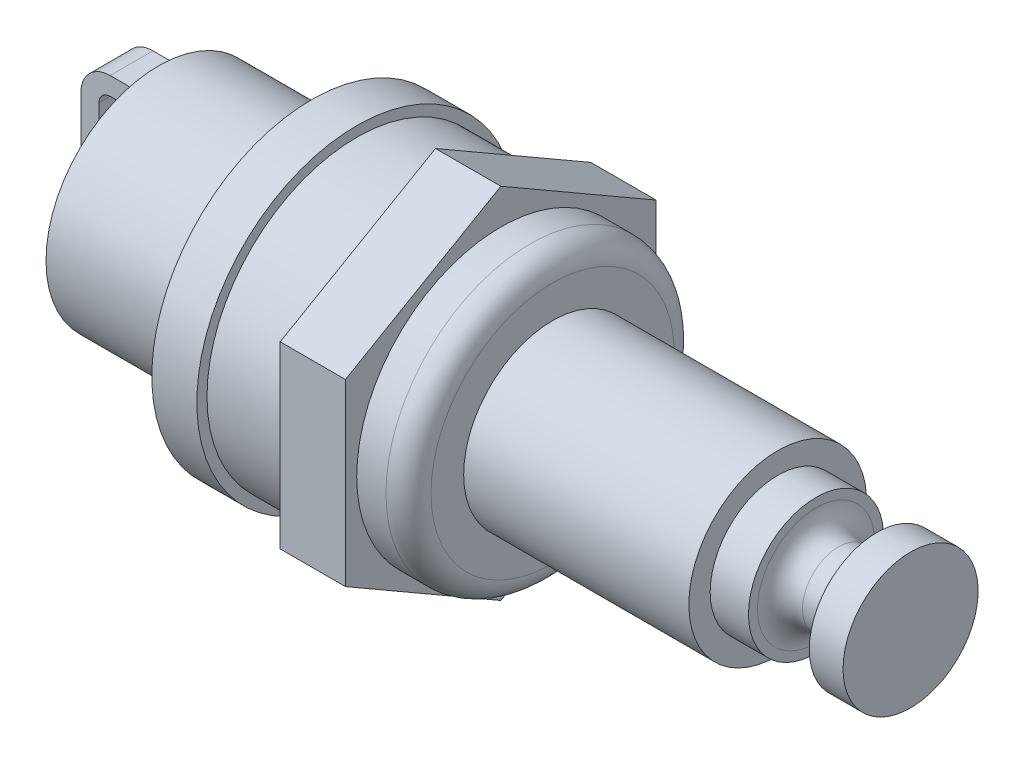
ISO-10303-21;
HEADER;
FILE_DESCRIPTION(('STEP AP214'),'2;1');
FILE_NAME('part.step','',(''),(''),'','','');
FILE_SCHEMA(('AUTOMOTIVE_DESIGN { 1 0 10303 214 1 1 1 1 }'));
ENDSEC;
DATA;
#1=APPLICATION_CONTEXT('core data for automotive mechanical design processes');
#2=APPLICATION_PROTOCOL_DEFINITION('international standard','automotive_design',2000,#1);
#3=PRODUCT_CONTEXT('',#1,'mechanical');
#4=PRODUCT('Part','Part','',(#3));
#5=PRODUCT_RELATED_PRODUCT_CATEGORY('part','',(#4));
#6=PRODUCT_DEFINITION_FORMATION('','',#4);
#7=PRODUCT_DEFINITION_CONTEXT('part definition',#1,'design');
#8=PRODUCT_DEFINITION('design','',#6,#7);
#9=PRODUCT_DEFINITION_SHAPE('','',#8);
#10=(LENGTH_UNIT() NAMED_UNIT(*) SI_UNIT(.MILLI.,.METRE.));
#11=(NAMED_UNIT(*) PLANE_ANGLE_UNIT() SI_UNIT($,.RADIAN.));
#12=(NAMED_UNIT(*) SI_UNIT($,.STERADIAN.) SOLID_ANGLE_UNIT());
#13=UNCERTAINTY_MEASURE_WITH_UNIT(LENGTH_MEASURE(1.E-05),#10,'distance_accuracy_value','');
#14=(GEOMETRIC_REPRESENTATION_CONTEXT(3) GLOBAL_UNCERTAINTY_ASSIGNED_CONTEXT((#13)) GLOBAL_UNIT_ASSIGNED_CONTEXT((#10,
#11,#12)) REPRESENTATION_CONTEXT('',''));
#15=CARTESIAN_POINT('',(0.,0.,0.));
#16=DIRECTION('',(0.,0.,1.));
#17=DIRECTION('',(1.,0.,0.));
#18=AXIS2_PLACEMENT_3D('',#15,#16,#17);
#19=CARTESIAN_POINT('',(-8.39999999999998,5.00000000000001,0.));
#20=DIRECTION('',(-1.,0.,0.));
#21=DIRECTION('',(0.,0.,0.999999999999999));
#22=AXIS2_PLACEMENT_3D('',#19,#20,#21);
#23=PLANE('',#22);
#24=CARTESIAN_POINT('',(-8.4,0.,0.));
#25=DIRECTION('',(1.,0.,0.));
#26=DIRECTION('',(0.,0.,-0.999999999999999));
#27=AXIS2_PLACEMENT_3D('',#24,#25,#26);
#28=CIRCLE('',#27,5.);
#29=CARTESIAN_POINT('',(-8.4,0.,-5.));
#30=VERTEX_POINT('',#29);
#31=EDGE_CURVE('E63',#30,#30,#28,.T.);
#32=ORIENTED_EDGE('',*,*,#31,.T.);
#33=EDGE_LOOP('',(#32));
#34=FACE_BOUND('',#33,.T.);
#35=CARTESIAN_POINT('',(-8.4,0.,0.));
#36=DIRECTION('',(1.,0.,0.));
#37=DIRECTION('',(0.,0.,-0.999999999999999));
#38=AXIS2_PLACEMENT_3D('',#35,#36,#37);
#39=CIRCLE('',#38,7.1);
#40=CARTESIAN_POINT('',(-8.4,0.,-7.1));
#41=VERTEX_POINT('',#40);
#42=EDGE_CURVE('E11',#41,#41,#39,.T.);
#43=ORIENTED_EDGE('',*,*,#42,.F.);
#44=EDGE_LOOP('',(#43));
#45=FACE_BOUND('',#44,.T.);
#46=ADVANCED_FACE('F49',(#34,#45),#23,.T.);
#47=CARTESIAN_POINT('',(-6.4,0.,0.));
#48=DIRECTION('',(1.,0.,0.));
#49=DIRECTION('',(0.,0.,-0.999999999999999));
#50=AXIS2_PLACEMENT_3D('',#47,#48,#49);
#51=CYLINDRICAL_SURFACE('',#50,7.1);
#52=CARTESIAN_POINT('',(-6.4,0.,0.));
#53=DIRECTION('',(1.,0.,0.));
#54=DIRECTION('',(0.,0.,-0.999999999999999));
#55=AXIS2_PLACEMENT_3D('',#52,#53,#54);
#56=CIRCLE('',#55,7.1);
#57=CARTESIAN_POINT('',(-6.4,0.,-7.1));
#58=VERTEX_POINT('',#57);
#59=EDGE_CURVE('E55',#58,#58,#56,.T.);
#60=CARTESIAN_POINT('',(-8.4,0.,-7.1));
#61=CARTESIAN_POINT('',(-8.37916666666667,0.,-7.1));
#62=CARTESIAN_POINT('',(-8.35833333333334,0.,-7.1));
#63=CARTESIAN_POINT('',(-8.31666666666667,0.,-7.1));
#64=CARTESIAN_POINT('',(-8.29583333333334,0.,-7.1));
#65=CARTESIAN_POINT('',(-8.25416666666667,0.,-7.1));
#66=CARTESIAN_POINT('',(-8.23333333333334,0.,-7.1));
#67=CARTESIAN_POINT('',(-8.19166666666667,0.,-7.1));
#68=CARTESIAN_POINT('',(-8.17083333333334,0.,-7.1));
#69=CARTESIAN_POINT('',(-8.12916666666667,0.,-7.1));
#70=CARTESIAN_POINT('',(-8.10833333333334,0.,-7.1));
#71=CARTESIAN_POINT('',(-8.06666666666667,0.,-7.1));
#72=CARTESIAN_POINT('',(-8.04583333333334,0.,-7.1));
#73=CARTESIAN_POINT('',(-8.00416666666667,0.,-7.1));
#74=CARTESIAN_POINT('',(-7.98333333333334,0.,-7.1));
#75=CARTESIAN_POINT('',(-7.94166666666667,0.,-7.1));
#76=CARTESIAN_POINT('',(-7.92083333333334,0.,-7.1));
#77=CARTESIAN_POINT('',(-7.87916666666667,0.,-7.1));
#78=CARTESIAN_POINT('',(-7.85833333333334,0.,-7.1));
#79=CARTESIAN_POINT('',(-7.81666666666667,0.,-7.1));
#80=CARTESIAN_POINT('',(-7.79583333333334,0.,-7.1));
#81=CARTESIAN_POINT('',(-7.75416666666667,0.,-7.1));
#82=CARTESIAN_POINT('',(-7.73333333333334,0.,-7.1));
#83=CARTESIAN_POINT('',(-7.69166666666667,0.,-7.1));
#84=CARTESIAN_POINT('',(-7.67083333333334,0.,-7.1));
#85=CARTESIAN_POINT('',(-7.62916666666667,0.,-7.1));
#86=CARTESIAN_POINT('',(-7.60833333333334,0.,-7.1));
#87=CARTESIAN_POINT('',(-7.56666666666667,0.,-7.1));
#88=CARTESIAN_POINT('',(-7.54583333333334,0.,-7.1));
#89=CARTESIAN_POINT('',(-7.50416666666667,0.,-7.1));
#90=CARTESIAN_POINT('',(-7.48333333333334,0.,-7.1));
#91=CARTESIAN_POINT('',(-7.44166666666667,0.,-7.1));
#92=CARTESIAN_POINT('',(-7.42083333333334,0.,-7.1));
#93=CARTESIAN_POINT('',(-7.37916666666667,0.,-7.1));
#94=CARTESIAN_POINT('',(-7.35833333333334,0.,-7.1));
#95=CARTESIAN_POINT('',(-7.31666666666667,0.,-7.1));
#96=CARTESIAN_POINT('',(-7.29583333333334,0.,-7.1));
#97=CARTESIAN_POINT('',(-7.25416666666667,0.,-7.1));
#98=CARTESIAN_POINT('',(-7.23333333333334,0.,-7.1));
#99=CARTESIAN_POINT('',(-7.19166666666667,0.,-7.1));
#100=CARTESIAN_POINT('',(-7.17083333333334,0.,-7.1));
#101=CARTESIAN_POINT('',(-7.12916666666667,0.,-7.1));
#102=CARTESIAN_POINT('',(-7.10833333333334,0.,-7.1));
#103=CARTESIAN_POINT('',(-7.06666666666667,0.,-7.1));
#104=CARTESIAN_POINT('',(-7.04583333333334,0.,-7.1));
#105=CARTESIAN_POINT('',(-7.00416666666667,0.,-7.1));
#106=CARTESIAN_POINT('',(-6.98333333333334,0.,-7.1));
#107=CARTESIAN_POINT('',(-6.94166666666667,0.,-7.1));
#108=CARTESIAN_POINT('',(-6.92083333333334,0.,-7.1));
#109=CARTESIAN_POINT('',(-6.87916666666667,0.,-7.1));
#110=CARTESIAN_POINT('',(-6.85833333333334,0.,-7.1));
#111=CARTESIAN_POINT('',(-6.81666666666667,0.,-7.1));
#112=CARTESIAN_POINT('',(-6.79583333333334,0.,-7.1));
#113=CARTESIAN_POINT('',(-6.75416666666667,0.,-7.1));
#114=CARTESIAN_POINT('',(-6.73333333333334,0.,-7.1));
#115=CARTESIAN_POINT('',(-6.69166666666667,0.,-7.1));
#116=CARTESIAN_POINT('',(-6.67083333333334,0.,-7.1));
#117=CARTESIAN_POINT('',(-6.62916666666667,0.,-7.1));
#118=CARTESIAN_POINT('',(-6.60833333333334,0.,-7.1));
#119=CARTESIAN_POINT('',(-6.56666666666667,0.,-7.1));
#120=CARTESIAN_POINT('',(-6.54583333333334,0.,-7.1));
#121=CARTESIAN_POINT('',(-6.50416666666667,0.,-7.1));
#122=CARTESIAN_POINT('',(-6.48333333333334,0.,-7.1));
#123=CARTESIAN_POINT('',(-6.44166666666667,0.,-7.1));
#124=CARTESIAN_POINT('',(-6.42083333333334,0.,-7.1));
#125=CARTESIAN_POINT('',(-6.4,0.,-7.1));
#126=B_SPLINE_CURVE_WITH_KNOTS('',3,(#60,#61,#62,#63,#64,#65,#66,#67,#68,#69,#70,#71,#72,#73,
#74,#75,#76,#77,#78,#79,#80,#81,#82,#83,#84,#85,#86,#87,#88,#89,#90,#91,#92,#93,#94,#95,#96,#97,
#98,#99,#100,#101,#102,#103,#104,#105,#106,#107,#108,#109,#110,#111,#112,#113,#114,#115,#116,
#117,#118,#119,#120,#121,#122,#123,#124,#125),.UNSPECIFIED.,.F.,.F.,(4,2,2,2,2,2,2,2,2,2,2,2,2,
2,2,2,2,2,2,2,2,2,2,2,2,2,2,2,2,2,2,2,4),(0.,0.0624999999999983,0.124999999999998,
0.187499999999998,0.25,0.3125,0.374999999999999,0.437499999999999,0.5,0.5625,0.625,0.6875,0.75,
0.8125,0.875,0.9375,1.,1.0625,1.125,1.1875,1.25,1.3125,1.375,1.4375,1.5,1.5625,1.625,1.6875,
1.75,1.8125,1.875,1.9375,2.),.UNSPECIFIED.);
#127=EDGE_CURVE('BSEAM79',#41,#58,#126,.T.);
#128=ORIENTED_EDGE('',*,*,#42,.T.);
#129=ORIENTED_EDGE('',*,*,#59,.F.);
#130=ORIENTED_EDGE('',*,*,#127,.T.);
#131=ORIENTED_EDGE('',*,*,#127,.F.);
#132=EDGE_LOOP('',(#128,#130,#129,#131));
#133=FACE_BOUND('',#132,.T.);
#134=ADVANCED_FACE('F79',(#133),#51,.T.);
#135=CARTESIAN_POINT('',(-6.39999999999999,5.,0.));
#136=DIRECTION('',(1.,0.,0.));
#137=DIRECTION('',(0.,0.,-0.999999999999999));
#138=AXIS2_PLACEMENT_3D('',#135,#136,#137);
#139=PLANE('',#138);
#140=ORIENTED_EDGE('',*,*,#59,.T.);
#141=EDGE_LOOP('',(#140));
#142=FACE_BOUND('',#141,.T.);
#143=CARTESIAN_POINT('',(-6.4,0.,0.));
#144=DIRECTION('',(1.,0.,0.));
#145=DIRECTION('',(0.,0.,-0.999999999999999));
#146=AXIS2_PLACEMENT_3D('',#143,#144,#145);
#147=CIRCLE('',#146,5.);
#148=CARTESIAN_POINT('',(-6.4,0.,-5.));
#149=VERTEX_POINT('',#148);
#150=EDGE_CURVE('E59',#149,#149,#147,.T.);
#151=ORIENTED_EDGE('',*,*,#150,.F.);
#152=EDGE_LOOP('',(#151));
#153=FACE_BOUND('',#152,.T.);
#154=ADVANCED_FACE('F73',(#142,#153),#139,.T.);
#155=CARTESIAN_POINT('',(-6.4,0.,0.));
#156=DIRECTION('',(1.,0.,0.));
#157=DIRECTION('',(0.,0.,-0.999999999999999));
#158=AXIS2_PLACEMENT_3D('',#155,#156,#157);
#159=CYLINDRICAL_SURFACE('',#158,5.);
#160=CARTESIAN_POINT('',(-6.4,0.,-5.));
#161=CARTESIAN_POINT('',(-6.42083333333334,0.,-5.));
#162=CARTESIAN_POINT('',(-6.44166666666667,0.,-5.));
#163=CARTESIAN_POINT('',(-6.48333333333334,0.,-5.));
#164=CARTESIAN_POINT('',(-6.50416666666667,0.,-5.));
#165=CARTESIAN_POINT('',(-6.54583333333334,0.,-5.));
#166=CARTESIAN_POINT('',(-6.56666666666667,0.,-5.));
#167=CARTESIAN_POINT('',(-6.60833333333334,0.,-5.));
#168=CARTESIAN_POINT('',(-6.62916666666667,0.,-5.));
#169=CARTESIAN_POINT('',(-6.67083333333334,0.,-5.));
#170=CARTESIAN_POINT('',(-6.69166666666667,0.,-5.));
#171=CARTESIAN_POINT('',(-6.73333333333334,0.,-5.));
#172=CARTESIAN_POINT('',(-6.75416666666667,0.,-5.));
#173=CARTESIAN_POINT('',(-6.79583333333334,0.,-5.));
#174=CARTESIAN_POINT('',(-6.81666666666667,0.,-5.));
#175=CARTESIAN_POINT('',(-6.85833333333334,0.,-5.));
#176=CARTESIAN_POINT('',(-6.87916666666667,0.,-5.));
#177=CARTESIAN_POINT('',(-6.92083333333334,0.,-5.));
#178=CARTESIAN_POINT('',(-6.94166666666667,0.,-5.));
#179=CARTESIAN_POINT('',(-6.98333333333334,0.,-5.));
#180=CARTESIAN_POINT('',(-7.00416666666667,0.,-5.));
#181=CARTESIAN_POINT('',(-7.04583333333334,0.,-5.));
#182=CARTESIAN_POINT('',(-7.06666666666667,0.,-5.));
#183=CARTESIAN_POINT('',(-7.10833333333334,0.,-5.));
#184=CARTESIAN_POINT('',(-7.12916666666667,0.,-5.));
#185=CARTESIAN_POINT('',(-7.17083333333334,0.,-5.));
#186=CARTESIAN_POINT('',(-7.19166666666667,0.,-5.));
#187=CARTESIAN_POINT('',(-7.23333333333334,0.,-5.));
#188=CARTESIAN_POINT('',(-7.25416666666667,0.,-5.));
#189=CARTESIAN_POINT('',(-7.29583333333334,0.,-5.));
#190=CARTESIAN_POINT('',(-7.31666666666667,0.,-5.));
#191=CARTESIAN_POINT('',(-7.35833333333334,0.,-5.));
#192=CARTESIAN_POINT('',(-7.37916666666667,0.,-5.));
#193=CARTESIAN_POINT('',(-7.42083333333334,0.,-5.));
#194=CARTESIAN_POINT('',(-7.44166666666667,0.,-5.));
#195=CARTESIAN_POINT('',(-7.48333333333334,0.,-5.));
#196=CARTESIAN_POINT('',(-7.50416666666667,0.,-5.));
#197=CARTESIAN_POINT('',(-7.54583333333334,0.,-5.));
#198=CARTESIAN_POINT('',(-7.56666666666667,0.,-5.));
#199=CARTESIAN_POINT('',(-7.60833333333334,0.,-5.));
#200=CARTESIAN_POINT('',(-7.62916666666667,0.,-5.));
#201=CARTESIAN_POINT('',(-7.67083333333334,0.,-5.));
#202=CARTESIAN_POINT('',(-7.69166666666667,0.,-5.));
#203=CARTESIAN_POINT('',(-7.73333333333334,0.,-5.));
#204=CARTESIAN_POINT('',(-7.75416666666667,0.,-5.));
#205=CARTESIAN_POINT('',(-7.79583333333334,0.,-5.));
#206=CARTESIAN_POINT('',(-7.81666666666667,0.,-5.));
#207=CARTESIAN_POINT('',(-7.85833333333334,0.,-5.));
#208=CARTESIAN_POINT('',(-7.87916666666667,0.,-5.));
#209=CARTESIAN_POINT('',(-7.92083333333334,0.,-5.));
#210=CARTESIAN_POINT('',(-7.94166666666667,0.,-5.));
#211=CARTESIAN_POINT('',(-7.98333333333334,0.,-5.));
#212=CARTESIAN_POINT('',(-8.00416666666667,0.,-5.));
#213=CARTESIAN_POINT('',(-8.04583333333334,0.,-5.));
#214=CARTESIAN_POINT('',(-8.06666666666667,0.,-5.));
#215=CARTESIAN_POINT('',(-8.10833333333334,0.,-5.));
#216=CARTESIAN_POINT('',(-8.12916666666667,0.,-5.));
#217=CARTESIAN_POINT('',(-8.17083333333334,0.,-5.));
#218=CARTESIAN_POINT('',(-8.19166666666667,0.,-5.));
#219=CARTESIAN_POINT('',(-8.23333333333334,0.,-5.));
#220=CARTESIAN_POINT('',(-8.25416666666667,0.,-5.));
#221=CARTESIAN_POINT('',(-8.29583333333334,0.,-5.));
#222=CARTESIAN_POINT('',(-8.31666666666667,0.,-5.));
#223=CARTESIAN_POINT('',(-8.35833333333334,0.,-5.));
#224=CARTESIAN_POINT('',(-8.37916666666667,0.,-5.));
#225=CARTESIAN_POINT('',(-8.4,0.,-5.));
#226=B_SPLINE_CURVE_WITH_KNOTS('',3,(#160,#161,#162,#163,#164,#165,#166,#167,#168,#169,#170,
#171,#172,#173,#174,#175,#176,#177,#178,#179,#180,#181,#182,#183,#184,#185,#186,#187,#188,#189,
#190,#191,#192,#193,#194,#195,#196,#197,#198,#199,#200,#201,#202,#203,#204,#205,#206,#207,#208,
#209,#210,#211,#212,#213,#214,#215,#216,#217,#218,#219,#220,#221,#222,#223,#224,#225),
.UNSPECIFIED.,.F.,.F.,(4,2,2,2,2,2,2,2,2,2,2,2,2,2,2,2,2,2,2,2,2,2,2,2,2,2,2,2,2,2,2,2,4),(0.,
0.0625000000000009,0.125000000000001,0.187500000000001,0.250000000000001,0.312500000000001,
0.375000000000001,0.437500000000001,0.500000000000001,0.562500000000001,0.625000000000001,
0.687500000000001,0.750000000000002,0.812500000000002,0.875000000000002,0.937500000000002,1.,
1.0625,1.125,1.1875,1.25,1.3125,1.375,1.4375,1.5,1.5625,1.625,1.6875,1.75,1.8125,1.875,1.9375,
2.),.UNSPECIFIED.);
#227=EDGE_CURVE('BSEAM71',#149,#30,#226,.T.);
#228=ORIENTED_EDGE('',*,*,#150,.T.);
#229=ORIENTED_EDGE('',*,*,#31,.F.);
#230=ORIENTED_EDGE('',*,*,#227,.T.);
#231=ORIENTED_EDGE('',*,*,#227,.F.);
#232=EDGE_LOOP('',(#228,#230,#229,#231));
#233=FACE_BOUND('',#232,.T.);
#234=ADVANCED_FACE('F71',(#233),#159,.F.);
#235=CLOSED_SHELL('',(#46,#134,#154,#234));
#236=MANIFOLD_SOLID_BREP('B2',#235);
#237=CARTESIAN_POINT('',(0.,0.,0.));
#238=DIRECTION('',(-1.,0.,0.));
#239=DIRECTION('',(0.,0.,0.999999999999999));
#240=AXIS2_PLACEMENT_3D('',#237,#238,#239);
#241=CYLINDRICAL_SURFACE('',#240,3.);
#242=CARTESIAN_POINT('',(12.3,0.,0.));
#243=DIRECTION('',(-1.,0.,0.));
#244=DIRECTION('',(0.,0.,0.999999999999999));
#245=AXIS2_PLACEMENT_3D('',#242,#243,#244);
#246=CIRCLE('',#245,3.);
#247=CARTESIAN_POINT('',(12.3,0.,3.));
#248=VERTEX_POINT('',#247);
#249=EDGE_CURVE('E332',#248,#248,#246,.T.);
#250=CARTESIAN_POINT('',(14.,0.,0.));
#251=DIRECTION('',(-1.,0.,0.));
#252=DIRECTION('',(0.,0.,0.999999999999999));
#253=AXIS2_PLACEMENT_3D('',#250,#251,#252);
#254=CIRCLE('',#253,3.);
#255=CARTESIAN_POINT('',(14.,0.,3.));
#256=VERTEX_POINT('',#255);
#257=EDGE_CURVE('E639',#256,#256,#254,.T.);
#258=CARTESIAN_POINT('',(12.3,0.,3.));
#259=CARTESIAN_POINT('',(12.3177083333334,0.,3.));
#260=CARTESIAN_POINT('',(12.3354166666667,0.,3.));
#261=CARTESIAN_POINT('',(12.3708333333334,0.,3.));
#262=CARTESIAN_POINT('',(12.3885416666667,0.,3.));
#263=CARTESIAN_POINT('',(12.4239583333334,0.,3.));
#264=CARTESIAN_POINT('',(12.4416666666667,0.,3.));
#265=CARTESIAN_POINT('',(12.4770833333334,0.,3.));
#266=CARTESIAN_POINT('',(12.4947916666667,0.,3.));
#267=CARTESIAN_POINT('',(12.5302083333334,0.,3.));
#268=CARTESIAN_POINT('',(12.5479166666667,0.,3.));
#269=CARTESIAN_POINT('',(12.5833333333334,0.,3.));
#270=CARTESIAN_POINT('',(12.6010416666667,0.,3.));
#271=CARTESIAN_POINT('',(12.6364583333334,0.,3.));
#272=CARTESIAN_POINT('',(12.6541666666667,0.,3.));
#273=CARTESIAN_POINT('',(12.6895833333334,0.,3.));
#274=CARTESIAN_POINT('',(12.7072916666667,0.,3.));
#275=CARTESIAN_POINT('',(12.7427083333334,0.,3.));
#276=CARTESIAN_POINT('',(12.7604166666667,0.,3.));
#277=CARTESIAN_POINT('',(12.7958333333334,0.,3.));
#278=CARTESIAN_POINT('',(12.8135416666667,0.,3.));
#279=CARTESIAN_POINT('',(12.8489583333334,0.,3.));
#280=CARTESIAN_POINT('',(12.8666666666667,0.,3.));
#281=CARTESIAN_POINT('',(12.9020833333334,0.,3.));
#282=CARTESIAN_POINT('',(12.9197916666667,0.,3.));
#283=CARTESIAN_POINT('',(12.9552083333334,0.,3.));
#284=CARTESIAN_POINT('',(12.9729166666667,0.,3.));
#285=CARTESIAN_POINT('',(13.0083333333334,0.,3.));
#286=CARTESIAN_POINT('',(13.0260416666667,0.,3.));
#287=CARTESIAN_POINT('',(13.0614583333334,0.,3.));
#288=CARTESIAN_POINT('',(13.0791666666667,0.,3.));
#289=CARTESIAN_POINT('',(13.1145833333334,0.,3.));
#290=CARTESIAN_POINT('',(13.1322916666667,0.,3.));
#291=CARTESIAN_POINT('',(13.1677083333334,0.,3.));
#292=CARTESIAN_POINT('',(13.1854166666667,0.,3.));
#293=CARTESIAN_POINT('',(13.2208333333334,0.,3.));
#294=CARTESIAN_POINT('',(13.2385416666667,0.,3.));
#295=CARTESIAN_POINT('',(13.2739583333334,0.,3.));
#296=CARTESIAN_POINT('',(13.2916666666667,0.,3.));
#297=CARTESIAN_POINT('',(13.3270833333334,0.,3.));
#298=CARTESIAN_POINT('',(13.3447916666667,0.,3.));
#299=CARTESIAN_POINT('',(13.3802083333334,0.,3.));
#300=CARTESIAN_POINT('',(13.3979166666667,0.,3.));
#301=CARTESIAN_POINT('',(13.4333333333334,0.,3.));
#302=CARTESIAN_POINT('',(13.4510416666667,0.,3.));
#303=CARTESIAN_POINT('',(13.4864583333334,0.,3.));
#304=CARTESIAN_POINT('',(13.5041666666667,0.,3.));
#305=CARTESIAN_POINT('',(13.5395833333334,0.,3.));
#306=CARTESIAN_POINT('',(13.5572916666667,0.,3.));
#307=CARTESIAN_POINT('',(13.5927083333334,0.,3.));
#308=CARTESIAN_POINT('',(13.6104166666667,0.,3.));
#309=CARTESIAN_POINT('',(13.6458333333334,0.,3.));
#310=CARTESIAN_POINT('',(13.6635416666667,0.,3.));
#311=CARTESIAN_POINT('',(13.6989583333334,0.,3.));
#312=CARTESIAN_POINT('',(13.7166666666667,0.,3.));
#313=CARTESIAN_POINT('',(13.7520833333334,0.,3.));
#314=CARTESIAN_POINT('',(13.7697916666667,0.,3.));
#315=CARTESIAN_POINT('',(13.8052083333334,0.,3.));
#316=CARTESIAN_POINT('',(13.8229166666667,0.,3.));
#317=CARTESIAN_POINT('',(13.8583333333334,0.,3.));
#318=CARTESIAN_POINT('',(13.8760416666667,0.,3.));
#319=CARTESIAN_POINT('',(13.9114583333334,0.,3.));
#320=CARTESIAN_POINT('',(13.9291666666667,0.,3.));
#321=CARTESIAN_POINT('',(13.9645833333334,0.,3.));
#322=CARTESIAN_POINT('',(13.9822916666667,0.,3.));
#323=CARTESIAN_POINT('',(14.,0.,3.));
#324=B_SPLINE_CURVE_WITH_KNOTS('',3,(#258,#259,#260,#261,#262,#263,#264,#265,#266,#267,#268,
#269,#270,#271,#272,#273,#274,#275,#276,#277,#278,#279,#280,#281,#282,#283,#284,#285,#286,#287,
#288,#289,#290,#291,#292,#293,#294,#295,#296,#297,#298,#299,#300,#301,#302,#303,#304,#305,#306,
#307,#308,#309,#310,#311,#312,#313,#314,#315,#316,#317,#318,#319,#320,#321,#322,#323),
.UNSPECIFIED.,.F.,.F.,(4,2,2,2,2,2,2,2,2,2,2,2,2,2,2,2,2,2,2,2,2,2,2,2,2,2,2,2,2,2,2,2,4),(0.,
0.0531250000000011,0.10625,0.159375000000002,0.212500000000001,0.265625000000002,
0.318750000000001,0.371875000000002,0.425000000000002,0.478125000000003,0.531250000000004,
0.584375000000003,0.637500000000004,0.690625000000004,0.743750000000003,0.796875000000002,
0.850000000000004,0.903125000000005,0.956250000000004,1.00937500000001,1.0625,1.11562500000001,
1.16875,1.22187500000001,1.27500000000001,1.32812500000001,1.38125000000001,1.43437500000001,
1.48750000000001,1.54062500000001,1.59375000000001,1.64687500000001,1.70000000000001),.UNSPECIFIED.);
#325=EDGE_CURVE('BSEAM105',#248,#256,#324,.T.);
#326=ORIENTED_EDGE('',*,*,#249,.F.);
#327=ORIENTED_EDGE('',*,*,#257,.T.);
#328=ORIENTED_EDGE('',*,*,#325,.T.);
#329=ORIENTED_EDGE('',*,*,#325,.F.);
#330=EDGE_LOOP('',(#326,#328,#327,#329));
#331=FACE_BOUND('',#330,.T.);
#332=ADVANCED_FACE('F105',(#331),#241,.T.);
#333=CARTESIAN_POINT('',(0.,0.,0.));
#334=DIRECTION('',(-1.,0.,0.));
#335=DIRECTION('',(0.,0.,0.999999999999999));
#336=AXIS2_PLACEMENT_3D('',#333,#334,#335);
#337=CYLINDRICAL_SURFACE('',#336,6.4);
#338=CARTESIAN_POINT('',(1.30000000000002,0.,0.));
#339=DIRECTION('',(-1.,0.,0.));
#340=DIRECTION('',(0.,0.,0.999999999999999));
#341=AXIS2_PLACEMENT_3D('',#338,#339,#340);
#342=CIRCLE('',#341,6.4);
#343=CARTESIAN_POINT('',(1.30000000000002,0.,6.4));
#344=VERTEX_POINT('',#343);
#345=EDGE_CURVE('E113',#344,#344,#342,.T.);
#346=CARTESIAN_POINT('',(0.,0.,0.));
#347=DIRECTION('',(-1.,0.,0.));
#348=DIRECTION('',(0.,0.,0.999999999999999));
#349=AXIS2_PLACEMENT_3D('',#346,#347,#348);
#350=CIRCLE('',#349,6.4);
#351=CARTESIAN_POINT('',(0.,0.,6.4));
#352=VERTEX_POINT('',#351);
#353=EDGE_CURVE('E341',#352,#352,#350,.T.);
#354=CARTESIAN_POINT('',(1.30000000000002,0.,6.4));
#355=CARTESIAN_POINT('',(1.28645833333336,0.,6.4));
#356=CARTESIAN_POINT('',(1.27291666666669,0.,6.4));
#357=CARTESIAN_POINT('',(1.24583333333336,0.,6.4));
#358=CARTESIAN_POINT('',(1.23229166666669,0.,6.4));
#359=CARTESIAN_POINT('',(1.20520833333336,0.,6.4));
#360=CARTESIAN_POINT('',(1.19166666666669,0.,6.4));
#361=CARTESIAN_POINT('',(1.16458333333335,0.,6.4));
#362=CARTESIAN_POINT('',(1.15104166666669,0.,6.4));
#363=CARTESIAN_POINT('',(1.12395833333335,0.,6.4));
#364=CARTESIAN_POINT('',(1.11041666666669,0.,6.4));
#365=CARTESIAN_POINT('',(1.08333333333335,0.,6.4));
#366=CARTESIAN_POINT('',(1.06979166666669,0.,6.4));
#367=CARTESIAN_POINT('',(1.04270833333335,0.,6.4));
#368=CARTESIAN_POINT('',(1.02916666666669,0.,6.4));
#369=CARTESIAN_POINT('',(1.00208333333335,0.,6.4));
#370=CARTESIAN_POINT('',(0.988541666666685,0.,6.4));
#371=CARTESIAN_POINT('',(0.961458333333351,0.,6.4));
#372=CARTESIAN_POINT('',(0.947916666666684,0.,6.4));
#373=CARTESIAN_POINT('',(0.92083333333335,0.,6.4));
#374=CARTESIAN_POINT('',(0.907291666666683,0.,6.4));
#375=CARTESIAN_POINT('',(0.88020833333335,0.,6.4));
#376=CARTESIAN_POINT('',(0.866666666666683,0.,6.4));
#377=CARTESIAN_POINT('',(0.839583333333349,0.,6.4));
#378=CARTESIAN_POINT('',(0.826041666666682,0.,6.4));
#379=CARTESIAN_POINT('',(0.798958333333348,0.,6.4));
#380=CARTESIAN_POINT('',(0.785416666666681,0.,6.4));
#381=CARTESIAN_POINT('',(0.758333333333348,0.,6.4));
#382=CARTESIAN_POINT('',(0.744791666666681,0.,6.4));
#383=CARTESIAN_POINT('',(0.717708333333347,0.,6.4));
#384=CARTESIAN_POINT('',(0.70416666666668,0.,6.4));
#385=CARTESIAN_POINT('',(0.677083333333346,0.,6.4));
#386=CARTESIAN_POINT('',(0.663541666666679,0.,6.4));
#387=CARTESIAN_POINT('',(0.636458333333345,0.,6.4));
#388=CARTESIAN_POINT('',(0.622916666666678,0.,6.4));
#389=CARTESIAN_POINT('',(0.595833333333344,0.,6.4));
#390=CARTESIAN_POINT('',(0.582291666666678,0.,6.4));
#391=CARTESIAN_POINT('',(0.555208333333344,0.,6.4));
#392=CARTESIAN_POINT('',(0.541666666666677,0.,6.4));
#393=CARTESIAN_POINT('',(0.514583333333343,0.,6.4));
#394=CARTESIAN_POINT('',(0.501041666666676,0.,6.4));
#395=CARTESIAN_POINT('',(0.473958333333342,0.,6.4));
#396=CARTESIAN_POINT('',(0.460416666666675,0.,6.4));
#397=CARTESIAN_POINT('',(0.433333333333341,0.,6.4));
#398=CARTESIAN_POINT('',(0.419791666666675,0.,6.4));
#399=CARTESIAN_POINT('',(0.392708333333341,0.,6.4));
#400=CARTESIAN_POINT('',(0.379166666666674,0.,6.4));
#401=CARTESIAN_POINT('',(0.35208333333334,0.,6.4));
#402=CARTESIAN_POINT('',(0.338541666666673,0.,6.4));
#403=CARTESIAN_POINT('',(0.311458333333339,0.,6.4));
#404=CARTESIAN_POINT('',(0.297916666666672,0.,6.4));
#405=CARTESIAN_POINT('',(0.270833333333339,0.,6.4));
#406=CARTESIAN_POINT('',(0.257291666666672,0.,6.4));
#407=CARTESIAN_POINT('',(0.230208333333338,0.,6.4));
#408=CARTESIAN_POINT('',(0.216666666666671,0.,6.4));
#409=CARTESIAN_POINT('',(0.189583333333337,0.,6.4));
#410=CARTESIAN_POINT('',(0.17604166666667,0.,6.4));
#411=CARTESIAN_POINT('',(0.148958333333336,0.,6.4));
#412=CARTESIAN_POINT('',(0.135416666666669,0.,6.4));
#413=CARTESIAN_POINT('',(0.108333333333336,0.,6.4));
#414=CARTESIAN_POINT('',(0.0947916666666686,0.,6.4));
#415=CARTESIAN_POINT('',(0.0677083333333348,0.,6.4));
#416=CARTESIAN_POINT('',(0.0541666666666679,0.,6.4));
#417=CARTESIAN_POINT('',(0.0270833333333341,0.,6.4));
#418=CARTESIAN_POINT('',(0.0135416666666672,0.,6.4));
#419=CARTESIAN_POINT('',(0.,0.,6.4));
#420=B_SPLINE_CURVE_WITH_KNOTS('',3,(#354,#355,#356,#357,#358,#359,#360,#361,#362,#363,#364,
#365,#366,#367,#368,#369,#370,#371,#372,#373,#374,#375,#376,#377,#378,#379,#380,#381,#382,#383,
#384,#385,#386,#387,#388,#389,#390,#391,#392,#393,#394,#395,#396,#397,#398,#399,#400,#401,#402,
#403,#404,#405,#406,#407,#408,#409,#410,#411,#412,#413,#414,#415,#416,#417,#418,#419),
.UNSPECIFIED.,.F.,.F.,(4,2,2,2,2,2,2,2,2,2,2,2,2,2,2,2,2,2,2,2,2,2,2,2,2,2,2,2,2,2,2,2,4),(0.,
0.0406250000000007,0.0812500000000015,0.121875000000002,0.162500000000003,0.203125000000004,
0.243750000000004,0.284375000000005,0.325000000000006,0.365625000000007,0.406250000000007,
0.446875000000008,0.487500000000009,0.528125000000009,0.56875000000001,0.609375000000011,
0.650000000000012,0.690625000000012,0.731250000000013,0.771875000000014,0.812500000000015,
0.853125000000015,0.893750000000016,0.934375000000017,0.975000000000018,1.01562500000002,
1.05625000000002,1.09687500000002,1.13750000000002,1.17812500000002,1.21875000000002,
1.25937500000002,1.30000000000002),.UNSPECIFIED.);
#421=EDGE_CURVE('BSEAM346',#344,#352,#420,.T.);
#422=ORIENTED_EDGE('',*,*,#345,.T.);
#423=ORIENTED_EDGE('',*,*,#353,.F.);
#424=ORIENTED_EDGE('',*,*,#421,.T.);
#425=ORIENTED_EDGE('',*,*,#421,.F.);
#426=EDGE_LOOP('',(#422,#424,#423,#425));
#427=FACE_BOUND('',#426,.T.);
#428=ADVANCED_FACE('F346',(#427),#337,.T.);
#429=CARTESIAN_POINT('',(2.30000000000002,6.40000000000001,0.));
#430=DIRECTION('',(-1.,0.,0.));
#431=DIRECTION('',(0.,0.,0.999999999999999));
#432=AXIS2_PLACEMENT_3D('',#429,#430,#431);
#433=PLANE('',#432);
#434=CARTESIAN_POINT('',(2.30000000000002,0.,0.));
#435=DIRECTION('',(-1.,0.,0.));
#436=DIRECTION('',(0.,0.,0.999999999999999));
#437=AXIS2_PLACEMENT_3D('',#434,#435,#436);
#438=CIRCLE('',#437,5.4);
#439=CARTESIAN_POINT('',(2.30000000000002,0.,5.4));
#440=VERTEX_POINT('',#439);
#441=EDGE_CURVE('E47',#440,#440,#438,.F.);
#442=ORIENTED_EDGE('',*,*,#441,.T.);
#443=EDGE_LOOP('',(#442));
#444=FACE_BOUND('',#443,.T.);
#445=CARTESIAN_POINT('',(2.30000000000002,0.,0.));
#446=DIRECTION('',(-1.,0.,0.));
#447=DIRECTION('',(0.,0.,0.999999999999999));
#448=AXIS2_PLACEMENT_3D('',#445,#446,#447);
#449=CIRCLE('',#448,3.95);
#450=CARTESIAN_POINT('',(2.30000000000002,0.,3.95));
#451=VERTEX_POINT('',#450);
#452=EDGE_CURVE('E338',#451,#451,#449,.T.);
#453=ORIENTED_EDGE('',*,*,#452,.T.);
#454=EDGE_LOOP('',(#453));
#455=FACE_BOUND('',#454,.T.);
#456=ADVANCED_FACE('F364',(#444,#455),#433,.F.);
#457=CARTESIAN_POINT('',(0.,0.,0.));
#458=DIRECTION('',(-1.,0.,0.));
#459=DIRECTION('',(0.,0.,0.999999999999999));
#460=AXIS2_PLACEMENT_3D('',#457,#458,#459);
#461=CYLINDRICAL_SURFACE('',#460,3.95);
#462=CARTESIAN_POINT('',(12.3,0.,0.));
#463=DIRECTION('',(-1.,0.,0.));
#464=DIRECTION('',(0.,0.,0.999999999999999));
#465=AXIS2_PLACEMENT_3D('',#462,#463,#464);
#466=CIRCLE('',#465,3.95);
#467=CARTESIAN_POINT('',(12.3,0.,3.95));
#468=VERTEX_POINT('',#467);
#469=EDGE_CURVE('E335',#468,#468,#466,.T.);
#470=CARTESIAN_POINT('',(2.30000000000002,0.,3.95));
#471=CARTESIAN_POINT('',(2.40416666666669,0.,3.95));
#472=CARTESIAN_POINT('',(2.50833333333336,0.,3.95));
#473=CARTESIAN_POINT('',(2.71666666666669,0.,3.95));
#474=CARTESIAN_POINT('',(2.82083333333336,0.,3.95));
#475=CARTESIAN_POINT('',(3.02916666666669,0.,3.95));
#476=CARTESIAN_POINT('',(3.13333333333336,0.,3.95));
#477=CARTESIAN_POINT('',(3.34166666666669,0.,3.95));
#478=CARTESIAN_POINT('',(3.44583333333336,0.,3.95));
#479=CARTESIAN_POINT('',(3.65416666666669,0.,3.95));
#480=CARTESIAN_POINT('',(3.75833333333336,0.,3.95));
#481=CARTESIAN_POINT('',(3.96666666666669,0.,3.95));
#482=CARTESIAN_POINT('',(4.07083333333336,0.,3.95));
#483=CARTESIAN_POINT('',(4.27916666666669,0.,3.95));
#484=CARTESIAN_POINT('',(4.38333333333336,0.,3.95));
#485=CARTESIAN_POINT('',(4.59166666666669,0.,3.95));
#486=CARTESIAN_POINT('',(4.69583333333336,0.,3.95));
#487=CARTESIAN_POINT('',(4.90416666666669,0.,3.95));
#488=CARTESIAN_POINT('',(5.00833333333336,0.,3.95));
#489=CARTESIAN_POINT('',(5.21666666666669,0.,3.95));
#490=CARTESIAN_POINT('',(5.32083333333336,0.,3.95));
#491=CARTESIAN_POINT('',(5.52916666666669,0.,3.95));
#492=CARTESIAN_POINT('',(5.63333333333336,0.,3.95));
#493=CARTESIAN_POINT('',(5.84166666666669,0.,3.95));
#494=CARTESIAN_POINT('',(5.94583333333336,0.,3.95));
#495=CARTESIAN_POINT('',(6.15416666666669,0.,3.95));
#496=CARTESIAN_POINT('',(6.25833333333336,0.,3.95));
#497=CARTESIAN_POINT('',(6.46666666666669,0.,3.95));
#498=CARTESIAN_POINT('',(6.57083333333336,0.,3.95));
#499=CARTESIAN_POINT('',(6.77916666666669,0.,3.95));
#500=CARTESIAN_POINT('',(6.88333333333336,0.,3.95));
#501=CARTESIAN_POINT('',(7.09166666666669,0.,3.95));
#502=CARTESIAN_POINT('',(7.19583333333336,0.,3.95));
#503=CARTESIAN_POINT('',(7.40416666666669,0.,3.95));
#504=CARTESIAN_POINT('',(7.50833333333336,0.,3.95));
#505=CARTESIAN_POINT('',(7.71666666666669,0.,3.95));
#506=CARTESIAN_POINT('',(7.82083333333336,0.,3.95));
#507=CARTESIAN_POINT('',(8.02916666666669,0.,3.95));
#508=CARTESIAN_POINT('',(8.13333333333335,0.,3.95));
#509=CARTESIAN_POINT('',(8.34166666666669,0.,3.95));
#510=CARTESIAN_POINT('',(8.44583333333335,0.,3.95));
#511=CARTESIAN_POINT('',(8.65416666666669,0.,3.95));
#512=CARTESIAN_POINT('',(8.75833333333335,0.,3.95));
#513=CARTESIAN_POINT('',(8.96666666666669,0.,3.95));
#514=CARTESIAN_POINT('',(9.07083333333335,0.,3.95));
#515=CARTESIAN_POINT('',(9.27916666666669,0.,3.95));
#516=CARTESIAN_POINT('',(9.38333333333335,0.,3.95));
#517=CARTESIAN_POINT('',(9.59166666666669,0.,3.95));
#518=CARTESIAN_POINT('',(9.69583333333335,0.,3.95));
#519=CARTESIAN_POINT('',(9.90416666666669,0.,3.95));
#520=CARTESIAN_POINT('',(10.0083333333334,0.,3.95));
#521=CARTESIAN_POINT('',(10.2166666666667,0.,3.95));
#522=CARTESIAN_POINT('',(10.3208333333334,0.,3.95));
#523=CARTESIAN_POINT('',(10.5291666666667,0.,3.95));
#524=CARTESIAN_POINT('',(10.6333333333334,0.,3.95));
#525=CARTESIAN_POINT('',(10.8416666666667,0.,3.95));
#526=CARTESIAN_POINT('',(10.9458333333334,0.,3.95));
#527=CARTESIAN_POINT('',(11.1541666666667,0.,3.95));
#528=CARTESIAN_POINT('',(11.2583333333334,0.,3.95));
#529=CARTESIAN_POINT('',(11.4666666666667,0.,3.95));
#530=CARTESIAN_POINT('',(11.5708333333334,0.,3.95));
#531=CARTESIAN_POINT('',(11.7791666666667,0.,3.95));
#532=CARTESIAN_POINT('',(11.8833333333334,0.,3.95));
#533=CARTESIAN_POINT('',(12.0916666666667,0.,3.95));
#534=CARTESIAN_POINT('',(12.1958333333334,0.,3.95));
#535=CARTESIAN_POINT('',(12.3,0.,3.95));
#536=B_SPLINE_CURVE_WITH_KNOTS('',3,(#470,#471,#472,#473,#474,#475,#476,#477,#478,#479,#480,
#481,#482,#483,#484,#485,#486,#487,#488,#489,#490,#491,#492,#493,#494,#495,#496,#497,#498,#499,
#500,#501,#502,#503,#504,#505,#506,#507,#508,#509,#510,#511,#512,#513,#514,#515,#516,#517,#518,
#519,#520,#521,#522,#523,#524,#525,#526,#527,#528,#529,#530,#531,#532,#533,#534,#535),
.UNSPECIFIED.,.F.,.F.,(4,2,2,2,2,2,2,2,2,2,2,2,2,2,2,2,2,2,2,2,2,2,2,2,2,2,2,2,2,2,2,2,4),(0.,
0.3125,0.625,0.9375,1.25,1.5625,1.875,2.1875,2.5,2.8125,3.125,3.4375,3.75,4.0625,4.375,4.6875,
5.,5.3125,5.625,5.9375,6.25,6.5625,6.875,7.1875,7.5,7.8125,8.12499999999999,8.43749999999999,
8.75,9.0625,9.37499999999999,9.68749999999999,9.99999999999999),.UNSPECIFIED.);
#537=EDGE_CURVE('BSEAM374',#451,#468,#536,.T.);
#538=ORIENTED_EDGE('',*,*,#452,.F.);
#539=ORIENTED_EDGE('',*,*,#469,.T.);
#540=ORIENTED_EDGE('',*,*,#537,.T.);
#541=ORIENTED_EDGE('',*,*,#537,.F.);
#542=EDGE_LOOP('',(#538,#540,#539,#541));
#543=FACE_BOUND('',#542,.T.);
#544=ADVANCED_FACE('F374',(#543),#461,.T.);
#545=CARTESIAN_POINT('',(12.3,3.95,0.));
#546=DIRECTION('',(-1.,0.,0.));
#547=DIRECTION('',(0.,0.,0.999999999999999));
#548=AXIS2_PLACEMENT_3D('',#545,#546,#547);
#549=PLANE('',#548);
#550=ORIENTED_EDGE('',*,*,#469,.F.);
#551=EDGE_LOOP('',(#550));
#552=FACE_BOUND('',#551,.T.);
#553=ORIENTED_EDGE('',*,*,#249,.T.);
#554=EDGE_LOOP('',(#553));
#555=FACE_BOUND('',#554,.T.);
#556=ADVANCED_FACE('F370',(#552,#555),#549,.F.);
#557=CARTESIAN_POINT('',(-23.9798481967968,-3.98371685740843,6.89999999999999));
#558=DIRECTION('',(0.,0.,-0.999999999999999));
#559=DIRECTION('',(0.,1.,0.));
#560=AXIS2_PLACEMENT_3D('',#557,#558,#559);
#561=PLANE('',#560);
#562=DIRECTION('',(0.,1.,0.));
#563=VECTOR('',#562,1.);
#564=CARTESIAN_POINT('',(-2.89999999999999,-3.98371685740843,6.89999999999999));
#565=LINE('',#564,#563);
#566=CARTESIAN_POINT('',(-2.89999999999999,-3.98371685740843,6.89999999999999));
#567=VERTEX_POINT('',#566);
#568=CARTESIAN_POINT('',(-2.89999999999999,3.98371685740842,6.9));
#569=VERTEX_POINT('',#568);
#570=EDGE_CURVE('E319',#567,#569,#565,.T.);
#571=ORIENTED_EDGE('',*,*,#570,.F.);
#572=DIRECTION('',(1.,0.,0.));
#573=VECTOR('',#572,1.);
#574=CARTESIAN_POINT('',(-23.9798481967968,-3.98371685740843,6.89999999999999));
#575=LINE('',#574,#573);
#576=CARTESIAN_POINT('',(0.,-3.98371685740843,6.9));
#577=VERTEX_POINT('',#576);
#578=EDGE_CURVE('E281',#567,#577,#575,.T.);
#579=ORIENTED_EDGE('',*,*,#578,.T.);
#580=DIRECTION('',(0.,1.,0.));
#581=VECTOR('',#580,1.);
#582=CARTESIAN_POINT('',(0.,-3.98371685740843,6.9));
#583=LINE('',#582,#581);
#584=CARTESIAN_POINT('',(0.,3.98371685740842,6.89999999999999));
#585=VERTEX_POINT('',#584);
#586=EDGE_CURVE('E303',#577,#585,#583,.T.);
#587=ORIENTED_EDGE('',*,*,#586,.T.);
#588=DIRECTION('',(1.,0.,0.));
#589=VECTOR('',#588,1.);
#590=CARTESIAN_POINT('',(-23.9798481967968,3.98371685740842,6.89999999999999));
#591=LINE('',#590,#589);
#592=EDGE_CURVE('E302',#569,#585,#591,.T.);
#593=ORIENTED_EDGE('',*,*,#592,.F.);
#594=EDGE_LOOP('',(#571,#579,#587,#593));
#595=FACE_BOUND('',#594,.T.);
#596=ADVANCED_FACE('F373',(#595),#561,.F.);
#597=CARTESIAN_POINT('',(-23.9798481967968,3.98371685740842,6.89999999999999));
#598=DIRECTION('',(0.,-0.866025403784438,-0.5));
#599=DIRECTION('',(0.,0.5,-0.866025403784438));
#600=AXIS2_PLACEMENT_3D('',#597,#598,#599);
#601=PLANE('',#600);
#602=DIRECTION('',(0.,0.5,-0.866025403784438));
#603=VECTOR('',#602,1.);
#604=CARTESIAN_POINT('',(-2.89999999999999,3.98371685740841,6.9));
#605=LINE('',#604,#603);
#606=CARTESIAN_POINT('',(-2.9,7.96743371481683,0.));
#607=VERTEX_POINT('',#606);
#608=EDGE_CURVE('E316',#569,#607,#605,.T.);
#609=ORIENTED_EDGE('',*,*,#608,.F.);
#610=ORIENTED_EDGE('',*,*,#592,.T.);
#611=DIRECTION('',(0.,0.5,-0.866025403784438));
#612=VECTOR('',#611,1.);
#613=CARTESIAN_POINT('',(0.,3.98371685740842,6.89999999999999));
#614=LINE('',#613,#612);
#615=CARTESIAN_POINT('',(0.,7.96743371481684,0.));
#616=VERTEX_POINT('',#615);
#617=EDGE_CURVE('E299',#585,#616,#614,.T.);
#618=ORIENTED_EDGE('',*,*,#617,.T.);
#619=DIRECTION('',(1.,0.,0.));
#620=VECTOR('',#619,1.);
#621=CARTESIAN_POINT('',(-23.9798481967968,7.96743371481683,0.));
#622=LINE('',#621,#620);
#623=EDGE_CURVE('E298',#607,#616,#622,.T.);
#624=ORIENTED_EDGE('',*,*,#623,.F.);
#625=EDGE_LOOP('',(#609,#610,#618,#624));
#626=FACE_BOUND('',#625,.T.);
#627=ADVANCED_FACE('F406',(#626),#601,.F.);
#628=CARTESIAN_POINT('',(-23.9798481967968,7.96743371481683,0.));
#629=DIRECTION('',(0.,-0.866025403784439,0.499999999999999));
#630=DIRECTION('',(0.,-0.499999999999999,-0.866025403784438));
#631=AXIS2_PLACEMENT_3D('',#628,#629,#630);
#632=PLANE('',#631);
#633=DIRECTION('',(0.,-0.499999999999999,-0.866025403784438));
#634=VECTOR('',#633,1.);
#635=CARTESIAN_POINT('',(-2.89999999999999,7.96743371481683,0.));
#636=LINE('',#635,#634);
#637=CARTESIAN_POINT('',(-2.89999999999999,3.98371685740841,-6.89999999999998));
#638=VERTEX_POINT('',#637);
#639=EDGE_CURVE('E313',#607,#638,#636,.T.);
#640=ORIENTED_EDGE('',*,*,#639,.F.);
#641=ORIENTED_EDGE('',*,*,#623,.T.);
#642=DIRECTION('',(0.,-0.5,-0.866025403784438));
#643=VECTOR('',#642,1.);
#644=CARTESIAN_POINT('',(0.,7.96743371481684,0.));
#645=LINE('',#644,#643);
#646=CARTESIAN_POINT('',(0.,3.98371685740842,-6.89999999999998));
#647=VERTEX_POINT('',#646);
#648=EDGE_CURVE('E295',#616,#647,#645,.T.);
#649=ORIENTED_EDGE('',*,*,#648,.T.);
#650=DIRECTION('',(1.,0.,0.));
#651=VECTOR('',#650,1.);
#652=CARTESIAN_POINT('',(-23.9798481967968,3.98371685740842,-6.89999999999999));
#653=LINE('',#652,#651);
#654=EDGE_CURVE('E294',#638,#647,#653,.T.);
#655=ORIENTED_EDGE('',*,*,#654,.F.);
#656=EDGE_LOOP('',(#640,#641,#649,#655));
#657=FACE_BOUND('',#656,.T.);
#658=ADVANCED_FACE('F415',(#657),#632,.F.);
#659=CARTESIAN_POINT('',(-23.9798481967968,3.98371685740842,-6.89999999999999));
#660=DIRECTION('',(0.,0.,0.999999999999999));
#661=DIRECTION('',(1.,0.,0.));
#662=AXIS2_PLACEMENT_3D('',#659,#660,#661);
#663=PLANE('',#662);
#664=DIRECTION('',(0.,-1.,0.));
#665=VECTOR('',#664,1.);
#666=CARTESIAN_POINT('',(-2.89999999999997,3.98371685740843,-6.89999999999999));
#667=LINE('',#666,#665);
#668=CARTESIAN_POINT('',(-2.89999999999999,-3.98371685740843,-6.89999999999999));
#669=VERTEX_POINT('',#668);
#670=EDGE_CURVE('E310',#638,#669,#667,.T.);
#671=ORIENTED_EDGE('',*,*,#670,.F.);
#672=ORIENTED_EDGE('',*,*,#654,.T.);
#673=DIRECTION('',(0.,-1.,0.));
#674=VECTOR('',#673,1.);
#675=CARTESIAN_POINT('',(0.,3.98371685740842,-6.89999999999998));
#676=LINE('',#675,#674);
#677=CARTESIAN_POINT('',(0.,-3.98371685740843,-6.89999999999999));
#678=VERTEX_POINT('',#677);
#679=EDGE_CURVE('E291',#647,#678,#676,.T.);
#680=ORIENTED_EDGE('',*,*,#679,.T.);
#681=DIRECTION('',(1.,0.,0.));
#682=VECTOR('',#681,1.);
#683=CARTESIAN_POINT('',(-23.9798481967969,-3.98371685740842,-6.89999999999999));
#684=LINE('',#683,#682);
#685=EDGE_CURVE('E290',#669,#678,#684,.T.);
#686=ORIENTED_EDGE('',*,*,#685,.F.);
#687=EDGE_LOOP('',(#671,#672,#680,#686));
#688=FACE_BOUND('',#687,.T.);
#689=ADVANCED_FACE('F423',(#688),#663,.F.);
#690=CARTESIAN_POINT('',(-23.9798481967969,-3.98371685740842,-6.89999999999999));
#691=DIRECTION('',(0.,0.866025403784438,0.5));
#692=DIRECTION('',(0.,-0.5,0.866025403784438));
#693=AXIS2_PLACEMENT_3D('',#690,#691,#692);
#694=PLANE('',#693);
#695=DIRECTION('',(0.,-0.5,0.866025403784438));
#696=VECTOR('',#695,1.);
#697=CARTESIAN_POINT('',(-2.89999999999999,-3.98371685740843,-6.89999999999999));
#698=LINE('',#697,#696);
#699=CARTESIAN_POINT('',(-2.9,-7.96743371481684,0.));
#700=VERTEX_POINT('',#699);
#701=EDGE_CURVE('E306',#669,#700,#698,.T.);
#702=ORIENTED_EDGE('',*,*,#701,.F.);
#703=ORIENTED_EDGE('',*,*,#685,.T.);
#704=DIRECTION('',(0.,-0.5,0.866025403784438));
#705=VECTOR('',#704,1.);
#706=CARTESIAN_POINT('',(0.,-3.98371685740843,-6.89999999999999));
#707=LINE('',#706,#705);
#708=CARTESIAN_POINT('',(0.,-7.96743371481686,0.));
#709=VERTEX_POINT('',#708);
#710=EDGE_CURVE('E287',#678,#709,#707,.T.);
#711=ORIENTED_EDGE('',*,*,#710,.T.);
#712=DIRECTION('',(1.,0.,0.));
#713=VECTOR('',#712,1.);
#714=CARTESIAN_POINT('',(-23.9798481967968,-7.96743371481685,0.));
#715=LINE('',#714,#713);
#716=EDGE_CURVE('E286',#700,#709,#715,.T.);
#717=ORIENTED_EDGE('',*,*,#716,.F.);
#718=EDGE_LOOP('',(#702,#703,#711,#717));
#719=FACE_BOUND('',#718,.T.);
#720=ADVANCED_FACE('F431',(#719),#694,.F.);
#721=CARTESIAN_POINT('',(-23.9798481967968,-7.96743371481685,0.));
#722=DIRECTION('',(0.,0.866025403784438,-0.5));
#723=DIRECTION('',(0.,0.5,0.866025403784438));
#724=AXIS2_PLACEMENT_3D('',#721,#722,#723);
#725=PLANE('',#724);
#726=DIRECTION('',(0.,0.5,0.866025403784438));
#727=VECTOR('',#726,1.);
#728=CARTESIAN_POINT('',(-2.89999999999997,-7.96743371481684,0.));
#729=LINE('',#728,#727);
#730=EDGE_CURVE('E285',#700,#567,#729,.T.);
#731=ORIENTED_EDGE('',*,*,#730,.F.);
#732=ORIENTED_EDGE('',*,*,#716,.T.);
#733=DIRECTION('',(0.,0.5,0.866025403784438));
#734=VECTOR('',#733,1.);
#735=CARTESIAN_POINT('',(0.,-7.96743371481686,0.));
#736=LINE('',#735,#734);
#737=EDGE_CURVE('E282',#709,#577,#736,.T.);
#738=ORIENTED_EDGE('',*,*,#737,.T.);
#739=ORIENTED_EDGE('',*,*,#578,.F.);
#740=EDGE_LOOP('',(#731,#732,#738,#739));
#741=FACE_BOUND('',#740,.T.);
#742=ADVANCED_FACE('F439',(#741),#725,.F.);
#743=CARTESIAN_POINT('',(0.,0.,0.));
#744=DIRECTION('',(-1.,0.,0.));
#745=DIRECTION('',(0.,0.,0.999999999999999));
#746=AXIS2_PLACEMENT_3D('',#743,#744,#745);
#747=PLANE('',#746);
#748=ORIENTED_EDGE('',*,*,#353,.T.);
#749=EDGE_LOOP('',(#748));
#750=FACE_BOUND('',#749,.T.);
#751=ORIENTED_EDGE('',*,*,#586,.F.);
#752=ORIENTED_EDGE('',*,*,#737,.F.);
#753=ORIENTED_EDGE('',*,*,#710,.F.);
#754=ORIENTED_EDGE('',*,*,#679,.F.);
#755=ORIENTED_EDGE('',*,*,#648,.F.);
#756=ORIENTED_EDGE('',*,*,#617,.F.);
#757=EDGE_LOOP('',(#751,#752,#753,#754,#755,#756));
#758=FACE_BOUND('',#757,.T.);
#759=ADVANCED_FACE('F447',(#750,#758),#747,.F.);
#760=CARTESIAN_POINT('',(-2.89999999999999,0.,0.));
#761=DIRECTION('',(-1.,0.,0.));
#762=DIRECTION('',(0.,0.,0.999999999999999));
#763=AXIS2_PLACEMENT_3D('',#760,#761,#762);
#764=PLANE('',#763);
#765=CARTESIAN_POINT('',(-2.89999999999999,0.,0.));
#766=DIRECTION('',(-1.,0.,0.));
#767=DIRECTION('',(0.,0.,0.999999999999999));
#768=AXIS2_PLACEMENT_3D('',#765,#766,#767);
#769=CIRCLE('',#768,6.65);
#770=CARTESIAN_POINT('',(-2.89999999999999,0.,6.65));
#771=VERTEX_POINT('',#770);
#772=EDGE_CURVE('E278',#771,#771,#769,.T.);
#773=ORIENTED_EDGE('',*,*,#772,.F.);
#774=EDGE_LOOP('',(#773));
#775=FACE_BOUND('',#774,.T.);
#776=ORIENTED_EDGE('',*,*,#730,.T.);
#777=ORIENTED_EDGE('',*,*,#570,.T.);
#778=ORIENTED_EDGE('',*,*,#608,.T.);
#779=ORIENTED_EDGE('',*,*,#639,.T.);
#780=ORIENTED_EDGE('',*,*,#670,.T.);
#781=ORIENTED_EDGE('',*,*,#701,.T.);
#782=EDGE_LOOP('',(#776,#777,#778,#779,#780,#781));
#783=FACE_BOUND('',#782,.T.);
#784=ADVANCED_FACE('F455',(#775,#783),#764,.T.);
#785=CARTESIAN_POINT('',(0.,0.,0.));
#786=DIRECTION('',(-1.,0.,0.));
#787=DIRECTION('',(0.,0.,0.999999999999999));
#788=AXIS2_PLACEMENT_3D('',#785,#786,#787);
#789=CYLINDRICAL_SURFACE('',#788,6.65);
#790=CARTESIAN_POINT('',(-6.4,0.,0.));
#791=DIRECTION('',(-1.,0.,0.));
#792=DIRECTION('',(0.,0.,0.999999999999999));
#793=AXIS2_PLACEMENT_3D('',#790,#791,#792);
#794=CIRCLE('',#793,6.65);
#795=CARTESIAN_POINT('',(-6.4,0.,6.65));
#796=VERTEX_POINT('',#795);
#797=EDGE_CURVE('E275',#796,#796,#794,.T.);
#798=CARTESIAN_POINT('',(-6.4,0.,6.65));
#799=CARTESIAN_POINT('',(-6.36354166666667,0.,6.65));
#800=CARTESIAN_POINT('',(-6.32708333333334,0.,6.65));
#801=CARTESIAN_POINT('',(-6.25416666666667,0.,6.65));
#802=CARTESIAN_POINT('',(-6.21770833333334,0.,6.65));
#803=CARTESIAN_POINT('',(-6.14479166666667,0.,6.65));
#804=CARTESIAN_POINT('',(-6.10833333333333,0.,6.65));
#805=CARTESIAN_POINT('',(-6.03541666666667,0.,6.65));
#806=CARTESIAN_POINT('',(-5.99895833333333,0.,6.65));
#807=CARTESIAN_POINT('',(-5.92604166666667,0.,6.65));
#808=CARTESIAN_POINT('',(-5.88958333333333,0.,6.65));
#809=CARTESIAN_POINT('',(-5.81666666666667,0.,6.65));
#810=CARTESIAN_POINT('',(-5.78020833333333,0.,6.65));
#811=CARTESIAN_POINT('',(-5.70729166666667,0.,6.65));
#812=CARTESIAN_POINT('',(-5.67083333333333,0.,6.65));
#813=CARTESIAN_POINT('',(-5.59791666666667,0.,6.65));
#814=CARTESIAN_POINT('',(-5.56145833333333,0.,6.65));
#815=CARTESIAN_POINT('',(-5.48854166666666,0.,6.65));
#816=CARTESIAN_POINT('',(-5.45208333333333,0.,6.65));
#817=CARTESIAN_POINT('',(-5.37916666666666,0.,6.65));
#818=CARTESIAN_POINT('',(-5.34270833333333,0.,6.65));
#819=CARTESIAN_POINT('',(-5.26979166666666,0.,6.65));
#820=CARTESIAN_POINT('',(-5.23333333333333,0.,6.65));
#821=CARTESIAN_POINT('',(-5.16041666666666,0.,6.65));
#822=CARTESIAN_POINT('',(-5.12395833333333,0.,6.65));
#823=CARTESIAN_POINT('',(-5.05104166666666,0.,6.65));
#824=CARTESIAN_POINT('',(-5.01458333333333,0.,6.65));
#825=CARTESIAN_POINT('',(-4.94166666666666,0.,6.65));
#826=CARTESIAN_POINT('',(-4.90520833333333,0.,6.65));
#827=CARTESIAN_POINT('',(-4.83229166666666,0.,6.65));
#828=CARTESIAN_POINT('',(-4.79583333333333,0.,6.65));
#829=CARTESIAN_POINT('',(-4.72291666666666,0.,6.65));
#830=CARTESIAN_POINT('',(-4.68645833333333,0.,6.65));
#831=CARTESIAN_POINT('',(-4.61354166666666,0.,6.65));
#832=CARTESIAN_POINT('',(-4.57708333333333,0.,6.65));
#833=CARTESIAN_POINT('',(-4.50416666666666,0.,6.65));
#834=CARTESIAN_POINT('',(-4.46770833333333,0.,6.65));
#835=CARTESIAN_POINT('',(-4.39479166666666,0.,6.65));
#836=CARTESIAN_POINT('',(-4.35833333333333,0.,6.65));
#837=CARTESIAN_POINT('',(-4.28541666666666,0.,6.65));
#838=CARTESIAN_POINT('',(-4.24895833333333,0.,6.65));
#839=CARTESIAN_POINT('',(-4.17604166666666,0.,6.65));
#840=CARTESIAN_POINT('',(-4.13958333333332,0.,6.65));
#841=CARTESIAN_POINT('',(-4.06666666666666,0.,6.65));
#842=CARTESIAN_POINT('',(-4.03020833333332,0.,6.65));
#843=CARTESIAN_POINT('',(-3.95729166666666,0.,6.65));
#844=CARTESIAN_POINT('',(-3.92083333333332,0.,6.65));
#845=CARTESIAN_POINT('',(-3.84791666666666,0.,6.65));
#846=CARTESIAN_POINT('',(-3.81145833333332,0.,6.65));
#847=CARTESIAN_POINT('',(-3.73854166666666,0.,6.65));
#848=CARTESIAN_POINT('',(-3.70208333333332,0.,6.65));
#849=CARTESIAN_POINT('',(-3.62916666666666,0.,6.65));
#850=CARTESIAN_POINT('',(-3.59270833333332,0.,6.65));
#851=CARTESIAN_POINT('',(-3.51979166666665,0.,6.65));
#852=CARTESIAN_POINT('',(-3.48333333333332,0.,6.65));
#853=CARTESIAN_POINT('',(-3.41041666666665,0.,6.65));
#854=CARTESIAN_POINT('',(-3.37395833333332,0.,6.65));
#855=CARTESIAN_POINT('',(-3.30104166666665,0.,6.65));
#856=CARTESIAN_POINT('',(-3.26458333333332,0.,6.65));
#857=CARTESIAN_POINT('',(-3.19166666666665,0.,6.65));
#858=CARTESIAN_POINT('',(-3.15520833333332,0.,6.65));
#859=CARTESIAN_POINT('',(-3.08229166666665,0.,6.65));
#860=CARTESIAN_POINT('',(-3.04583333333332,0.,6.65));
#861=CARTESIAN_POINT('',(-2.97291666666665,0.,6.65));
#862=CARTESIAN_POINT('',(-2.93645833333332,0.,6.65));
#863=CARTESIAN_POINT('',(-2.89999999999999,0.,6.65));
#864=B_SPLINE_CURVE_WITH_KNOTS('',3,(#798,#799,#800,#801,#802,#803,#804,#805,#806,#807,#808,
#809,#810,#811,#812,#813,#814,#815,#816,#817,#818,#819,#820,#821,#822,#823,#824,#825,#826,#827,
#828,#829,#830,#831,#832,#833,#834,#835,#836,#837,#838,#839,#840,#841,#842,#843,#844,#845,#846,
#847,#848,#849,#850,#851,#852,#853,#854,#855,#856,#857,#858,#859,#860,#861,#862,#863),
.UNSPECIFIED.,.F.,.F.,(4,2,2,2,2,2,2,2,2,2,2,2,2,2,2,2,2,2,2,2,2,2,2,2,2,2,2,2,2,2,2,2,4),(0.,
0.109375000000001,0.218750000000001,0.328125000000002,0.437500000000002,0.546875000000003,
0.656250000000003,0.765625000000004,0.875000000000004,0.984375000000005,1.09375000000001,
1.20312500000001,1.31250000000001,1.42187500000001,1.53125000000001,1.64062500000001,
1.75000000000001,1.85937500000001,1.96875000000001,2.07812500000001,2.18750000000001,
2.29687500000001,2.40625000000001,2.51562500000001,2.62500000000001,2.73437500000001,
2.84375000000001,2.95312500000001,3.06250000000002,3.17187500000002,3.28125000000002,
3.39062500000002,3.50000000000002),.UNSPECIFIED.);
#865=EDGE_CURVE('BSEAM463',#796,#771,#864,.T.);
#866=ORIENTED_EDGE('',*,*,#797,.F.);
#867=ORIENTED_EDGE('',*,*,#772,.T.);
#868=ORIENTED_EDGE('',*,*,#865,.T.);
#869=ORIENTED_EDGE('',*,*,#865,.F.);
#870=EDGE_LOOP('',(#866,#868,#867,#869));
#871=FACE_BOUND('',#870,.T.);
#872=ADVANCED_FACE('F463',(#871),#789,.T.);
#873=CARTESIAN_POINT('',(-6.39999999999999,6.65000000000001,0.));
#874=DIRECTION('',(1.,0.,0.));
#875=DIRECTION('',(0.,0.,-0.999999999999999));
#876=AXIS2_PLACEMENT_3D('',#873,#874,#875);
#877=PLANE('',#876);
#878=CARTESIAN_POINT('',(-6.4,0.,0.));
#879=DIRECTION('',(-1.,0.,0.));
#880=DIRECTION('',(0.,0.,0.999999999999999));
#881=AXIS2_PLACEMENT_3D('',#878,#879,#880);
#882=CIRCLE('',#881,5.);
#883=CARTESIAN_POINT('',(-6.4,0.,5.));
#884=VERTEX_POINT('',#883);
#885=EDGE_CURVE('E272',#884,#884,#882,.T.);
#886=ORIENTED_EDGE('',*,*,#885,.F.);
#887=EDGE_LOOP('',(#886));
#888=FACE_BOUND('',#887,.T.);
#889=ORIENTED_EDGE('',*,*,#797,.T.);
#890=EDGE_LOOP('',(#889));
#891=FACE_BOUND('',#890,.T.);
#892=ADVANCED_FACE('F471',(#888,#891),#877,.F.);
#893=CARTESIAN_POINT('',(0.,0.,0.));
#894=DIRECTION('',(-1.,0.,0.));
#895=DIRECTION('',(0.,0.,0.999999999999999));
#896=AXIS2_PLACEMENT_3D('',#893,#894,#895);
#897=CYLINDRICAL_SURFACE('',#896,5.);
#898=CARTESIAN_POINT('',(-15.2,0.,0.));
#899=DIRECTION('',(-1.,0.,0.));
#900=DIRECTION('',(0.,0.,0.999999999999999));
#901=AXIS2_PLACEMENT_3D('',#898,#899,#900);
#902=CIRCLE('',#901,5.);
#903=CARTESIAN_POINT('',(-15.2,0.,5.));
#904=VERTEX_POINT('',#903);
#905=EDGE_CURVE('E269',#904,#904,#902,.T.);
#906=CARTESIAN_POINT('',(-15.2,0.,5.));
#907=CARTESIAN_POINT('',(-15.1083333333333,0.,5.));
#908=CARTESIAN_POINT('',(-15.0166666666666,0.,5.));
#909=CARTESIAN_POINT('',(-14.8333333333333,0.,5.));
#910=CARTESIAN_POINT('',(-14.7416666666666,0.,5.));
#911=CARTESIAN_POINT('',(-14.5583333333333,0.,5.));
#912=CARTESIAN_POINT('',(-14.4666666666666,0.,5.));
#913=CARTESIAN_POINT('',(-14.2833333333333,0.,5.));
#914=CARTESIAN_POINT('',(-14.1916666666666,0.,5.));
#915=CARTESIAN_POINT('',(-14.0083333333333,0.,5.));
#916=CARTESIAN_POINT('',(-13.9166666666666,0.,5.));
#917=CARTESIAN_POINT('',(-13.7333333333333,0.,5.));
#918=CARTESIAN_POINT('',(-13.6416666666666,0.,5.));
#919=CARTESIAN_POINT('',(-13.4583333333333,0.,5.));
#920=CARTESIAN_POINT('',(-13.3666666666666,0.,5.));
#921=CARTESIAN_POINT('',(-13.1833333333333,0.,5.));
#922=CARTESIAN_POINT('',(-13.0916666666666,0.,5.));
#923=CARTESIAN_POINT('',(-12.9083333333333,0.,5.));
#924=CARTESIAN_POINT('',(-12.8166666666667,0.,5.));
#925=CARTESIAN_POINT('',(-12.6333333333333,0.,5.));
#926=CARTESIAN_POINT('',(-12.5416666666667,0.,5.));
#927=CARTESIAN_POINT('',(-12.3583333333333,0.,5.));
#928=CARTESIAN_POINT('',(-12.2666666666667,0.,5.));
#929=CARTESIAN_POINT('',(-12.0833333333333,0.,5.));
#930=CARTESIAN_POINT('',(-11.9916666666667,0.,5.));
#931=CARTESIAN_POINT('',(-11.8083333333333,0.,5.));
#932=CARTESIAN_POINT('',(-11.7166666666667,0.,5.));
#933=CARTESIAN_POINT('',(-11.5333333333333,0.,5.));
#934=CARTESIAN_POINT('',(-11.4416666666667,0.,5.));
#935=CARTESIAN_POINT('',(-11.2583333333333,0.,5.));
#936=CARTESIAN_POINT('',(-11.1666666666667,0.,5.));
#937=CARTESIAN_POINT('',(-10.9833333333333,0.,5.));
#938=CARTESIAN_POINT('',(-10.8916666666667,0.,5.));
#939=CARTESIAN_POINT('',(-10.7083333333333,0.,5.));
#940=CARTESIAN_POINT('',(-10.6166666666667,0.,5.));
#941=CARTESIAN_POINT('',(-10.4333333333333,0.,5.));
#942=CARTESIAN_POINT('',(-10.3416666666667,0.,5.));
#943=CARTESIAN_POINT('',(-10.1583333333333,0.,5.));
#944=CARTESIAN_POINT('',(-10.0666666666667,0.,5.));
#945=CARTESIAN_POINT('',(-9.88333333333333,0.,5.));
#946=CARTESIAN_POINT('',(-9.79166666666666,0.,5.));
#947=CARTESIAN_POINT('',(-9.60833333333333,0.,5.));
#948=CARTESIAN_POINT('',(-9.51666666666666,0.,5.));
#949=CARTESIAN_POINT('',(-9.33333333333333,0.,5.));
#950=CARTESIAN_POINT('',(-9.24166666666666,0.,5.));
#951=CARTESIAN_POINT('',(-9.05833333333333,0.,5.));
#952=CARTESIAN_POINT('',(-8.96666666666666,0.,5.));
#953=CARTESIAN_POINT('',(-8.78333333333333,0.,5.));
#954=CARTESIAN_POINT('',(-8.69166666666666,0.,5.));
#955=CARTESIAN_POINT('',(-8.50833333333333,0.,5.));
#956=CARTESIAN_POINT('',(-8.41666666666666,0.,5.));
#957=CARTESIAN_POINT('',(-8.23333333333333,0.,5.));
#958=CARTESIAN_POINT('',(-8.14166666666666,0.,5.));
#959=CARTESIAN_POINT('',(-7.95833333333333,0.,5.));
#960=CARTESIAN_POINT('',(-7.86666666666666,0.,5.));
#961=CARTESIAN_POINT('',(-7.68333333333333,0.,5.));
#962=CARTESIAN_POINT('',(-7.59166666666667,0.,5.));
#963=CARTESIAN_POINT('',(-7.40833333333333,0.,5.));
#964=CARTESIAN_POINT('',(-7.31666666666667,0.,5.));
#965=CARTESIAN_POINT('',(-7.13333333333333,0.,5.));
#966=CARTESIAN_POINT('',(-7.04166666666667,0.,5.));
#967=CARTESIAN_POINT('',(-6.85833333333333,0.,5.));
#968=CARTESIAN_POINT('',(-6.76666666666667,0.,5.));
#969=CARTESIAN_POINT('',(-6.58333333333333,0.,5.));
#970=CARTESIAN_POINT('',(-6.49166666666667,0.,5.));
#971=CARTESIAN_POINT('',(-6.4,0.,5.));
#972=B_SPLINE_CURVE_WITH_KNOTS('',3,(#906,#907,#908,#909,#910,#911,#912,#913,#914,#915,#916,
#917,#918,#919,#920,#921,#922,#923,#924,#925,#926,#927,#928,#929,#930,#931,#932,#933,#934,#935,
#936,#937,#938,#939,#940,#941,#942,#943,#944,#945,#946,#947,#948,#949,#950,#951,#952,#953,#954,
#955,#956,#957,#958,#959,#960,#961,#962,#963,#964,#965,#966,#967,#968,#969,#970,#971),
.UNSPECIFIED.,.F.,.F.,(4,2,2,2,2,2,2,2,2,2,2,2,2,2,2,2,2,2,2,2,2,2,2,2,2,2,2,2,2,2,2,2,4),(0.,
0.274999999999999,0.549999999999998,0.824999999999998,1.1,1.375,1.65,1.92499999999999,
2.19999999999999,2.47499999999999,2.74999999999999,3.02499999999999,3.29999999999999,
3.57499999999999,3.84999999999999,4.12499999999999,4.39999999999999,4.67499999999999,
4.94999999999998,5.22499999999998,5.49999999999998,5.77499999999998,6.04999999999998,
6.32499999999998,6.59999999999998,6.87499999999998,7.14999999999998,7.42499999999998,
7.69999999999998,7.97499999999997,8.24999999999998,8.52499999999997,8.79999999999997),.UNSPECIFIED.);
#973=EDGE_CURVE('BSEAM480',#904,#884,#972,.T.);
#974=ORIENTED_EDGE('',*,*,#905,.F.);
#975=ORIENTED_EDGE('',*,*,#885,.T.);
#976=ORIENTED_EDGE('',*,*,#973,.T.);
#977=ORIENTED_EDGE('',*,*,#973,.F.);
#978=EDGE_LOOP('',(#974,#976,#975,#977));
#979=FACE_BOUND('',#978,.T.);
#980=ADVANCED_FACE('F480',(#979),#897,.T.);
#981=CARTESIAN_POINT('',(-15.2,4.99999999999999,0.));
#982=DIRECTION('',(1.,0.,0.));
#983=DIRECTION('',(0.,0.,-0.999999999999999));
#984=AXIS2_PLACEMENT_3D('',#981,#982,#983);
#985=PLANE('',#984);
#986=DIRECTION('',(0.,0.,-0.999999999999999));
#987=VECTOR('',#986,1.);
#988=CARTESIAN_POINT('',(-15.2,4.5,0.950000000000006));
#989=LINE('',#988,#987);
#990=CARTESIAN_POINT('',(-15.2,4.5,0.950000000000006));
#991=VERTEX_POINT('',#990);
#992=CARTESIAN_POINT('',(-15.2,4.5,-0.949999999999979));
#993=VERTEX_POINT('',#992);
#994=EDGE_CURVE('E120',#991,#993,#989,.T.);
#995=ORIENTED_EDGE('',*,*,#994,.F.);
#996=DIRECTION('',(0.,0.999999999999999,0.));
#997=VECTOR('',#996,1.);
#998=CARTESIAN_POINT('',(-15.2,3.69999999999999,0.95000000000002));
#999=LINE('',#998,#997);
#1000=CARTESIAN_POINT('',(-15.2,3.69999999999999,0.95000000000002));
#1001=VERTEX_POINT('',#1000);
#1002=EDGE_CURVE('E125',#1001,#991,#999,.T.);
#1003=ORIENTED_EDGE('',*,*,#1002,.F.);
#1004=DIRECTION('',(0.,0.,-0.999999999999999));
#1005=VECTOR('',#1004,1.);
#1006=CARTESIAN_POINT('',(-15.2,3.69999999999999,0.95000000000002));
#1007=LINE('',#1006,#1005);
#1008=CARTESIAN_POINT('',(-15.2,3.7,-0.949999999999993));
#1009=VERTEX_POINT('',#1008);
#1010=EDGE_CURVE('E236',#1001,#1009,#1007,.T.);
#1011=ORIENTED_EDGE('',*,*,#1010,.T.);
#1012=DIRECTION('',(0.,0.999999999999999,0.));
#1013=VECTOR('',#1012,1.);
#1014=CARTESIAN_POINT('',(-15.2,3.7,-0.949999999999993));
#1015=LINE('',#1014,#1013);
#1016=EDGE_CURVE('E237',#1009,#993,#1015,.T.);
#1017=ORIENTED_EDGE('',*,*,#1016,.T.);
#1018=EDGE_LOOP('',(#995,#1003,#1011,#1017));
#1019=FACE_BOUND('',#1018,.T.);
#1020=ORIENTED_EDGE('',*,*,#905,.T.);
#1021=EDGE_LOOP('',(#1020));
#1022=FACE_BOUND('',#1021,.T.);
#1023=ADVANCED_FACE('F488',(#1019,#1022),#985,.F.);
#1024=CARTESIAN_POINT('',(-15.2,4.5,0.950000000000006));
#1025=DIRECTION('',(0.,-0.999999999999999,0.));
#1026=DIRECTION('',(1.,0.,0.));
#1027=AXIS2_PLACEMENT_3D('',#1024,#1025,#1026);
#1028=PLANE('',#1027);
#1029=DIRECTION('',(-1.,0.,0.));
#1030=VECTOR('',#1029,1.);
#1031=CARTESIAN_POINT('',(-15.2,4.5,-0.949999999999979));
#1032=LINE('',#1031,#1030);
#1033=CARTESIAN_POINT('',(-16.4,4.5,-0.949999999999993));
#1034=VERTEX_POINT('',#1033);
#1035=EDGE_CURVE('E215',#993,#1034,#1032,.T.);
#1036=ORIENTED_EDGE('',*,*,#1035,.T.);
#1037=DIRECTION('',(0.,0.,-0.999999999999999));
#1038=VECTOR('',#1037,1.);
#1039=CARTESIAN_POINT('',(-16.4,4.49999999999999,0.95000000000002));
#1040=LINE('',#1039,#1038);
#1041=CARTESIAN_POINT('',(-16.4,4.49999999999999,0.95000000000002));
#1042=VERTEX_POINT('',#1041);
#1043=EDGE_CURVE('E212',#1042,#1034,#1040,.T.);
#1044=ORIENTED_EDGE('',*,*,#1043,.F.);
#1045=DIRECTION('',(-1.,0.,0.));
#1046=VECTOR('',#1045,1.);
#1047=CARTESIAN_POINT('',(-15.2,4.5,0.950000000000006));
#1048=LINE('',#1047,#1046);
#1049=EDGE_CURVE('E203',#991,#1042,#1048,.T.);
#1050=ORIENTED_EDGE('',*,*,#1049,.F.);
#1051=ORIENTED_EDGE('',*,*,#994,.T.);
#1052=EDGE_LOOP('',(#1036,#1044,#1050,#1051));
#1053=FACE_BOUND('',#1052,.T.);
#1054=ADVANCED_FACE('F213',(#1053),#1028,.F.);
#1055=CARTESIAN_POINT('',(-16.4,3.2,0.949999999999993));
#1056=DIRECTION('',(0.,0.,-0.999999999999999));
#1057=DIRECTION('',(-1.,0.,0.));
#1058=AXIS2_PLACEMENT_3D('',#1055,#1056,#1057);
#1059=CYLINDRICAL_SURFACE('',#1058,1.3);
#1060=CARTESIAN_POINT('',(-16.4,3.2,-0.950000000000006));
#1061=DIRECTION('',(0.,0.,0.999999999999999));
#1062=DIRECTION('',(1.,0.,0.));
#1063=AXIS2_PLACEMENT_3D('',#1060,#1061,#1062);
#1064=CIRCLE('',#1063,1.3);
#1065=CARTESIAN_POINT('',(-17.7,3.2,-0.95000000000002));
#1066=VERTEX_POINT('',#1065);
#1067=EDGE_CURVE('E241',#1034,#1066,#1064,.T.);
#1068=ORIENTED_EDGE('',*,*,#1067,.T.);
#1069=DIRECTION('',(0.,0.,-0.999999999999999));
#1070=VECTOR('',#1069,1.);
#1071=CARTESIAN_POINT('',(-17.7,3.19999999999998,0.950000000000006));
#1072=LINE('',#1071,#1070);
#1073=CARTESIAN_POINT('',(-17.7,3.19999999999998,0.950000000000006));
#1074=VERTEX_POINT('',#1073);
#1075=EDGE_CURVE('E218',#1074,#1066,#1072,.T.);
#1076=ORIENTED_EDGE('',*,*,#1075,.F.);
#1077=CARTESIAN_POINT('',(-16.4,3.2,0.949999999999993));
#1078=DIRECTION('',(0.,0.,0.999999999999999));
#1079=DIRECTION('',(1.,0.,0.));
#1080=AXIS2_PLACEMENT_3D('',#1077,#1078,#1079);
#1081=CIRCLE('',#1080,1.3);
#1082=EDGE_CURVE('E207',#1042,#1074,#1081,.T.);
#1083=ORIENTED_EDGE('',*,*,#1082,.F.);
#1084=ORIENTED_EDGE('',*,*,#1043,.T.);
#1085=EDGE_LOOP('',(#1068,#1076,#1083,#1084));
#1086=FACE_BOUND('',#1085,.T.);
#1087=ADVANCED_FACE('F220',(#1086),#1059,.T.);
#1088=CARTESIAN_POINT('',(-17.7,3.19999999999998,0.950000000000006));
#1089=DIRECTION('',(1.,0.,0.));
#1090=DIRECTION('',(0.,0.,-0.999999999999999));
#1091=AXIS2_PLACEMENT_3D('',#1088,#1089,#1090);
#1092=PLANE('',#1091);
#1093=DIRECTION('',(0.,-1.,0.));
#1094=VECTOR('',#1093,1.);
#1095=CARTESIAN_POINT('',(-17.7,3.2,-0.95000000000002));
#1096=LINE('',#1095,#1094);
#1097=CARTESIAN_POINT('',(-17.7,0.500000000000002,-0.949999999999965));
#1098=VERTEX_POINT('',#1097);
#1099=EDGE_CURVE('E243',#1066,#1098,#1096,.T.);
#1100=ORIENTED_EDGE('',*,*,#1099,.T.);
#1101=DIRECTION('',(0.,0.,-0.999999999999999));
#1102=VECTOR('',#1101,1.);
#1103=CARTESIAN_POINT('',(-17.7,0.499999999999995,0.950000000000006));
#1104=LINE('',#1103,#1102);
#1105=CARTESIAN_POINT('',(-17.7,0.499999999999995,0.950000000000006));
#1106=VERTEX_POINT('',#1105);
#1107=EDGE_CURVE('E264',#1106,#1098,#1104,.T.);
#1108=ORIENTED_EDGE('',*,*,#1107,.F.);
#1109=DIRECTION('',(0.,-1.,0.));
#1110=VECTOR('',#1109,1.);
#1111=CARTESIAN_POINT('',(-17.7,3.19999999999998,0.950000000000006));
#1112=LINE('',#1111,#1110);
#1113=EDGE_CURVE('E223',#1074,#1106,#1112,.T.);
#1114=ORIENTED_EDGE('',*,*,#1113,.F.);
#1115=ORIENTED_EDGE('',*,*,#1075,.T.);
#1116=EDGE_LOOP('',(#1100,#1108,#1114,#1115));
#1117=FACE_BOUND('',#1116,.T.);
#1118=ADVANCED_FACE('F506',(#1117),#1092,.F.);
#1119=CARTESIAN_POINT('',(-17.7,0.499999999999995,0.950000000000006));
#1120=DIRECTION('',(0.,1.,0.));
#1121=DIRECTION('',(0.,0.,0.999999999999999));
#1122=AXIS2_PLACEMENT_3D('',#1119,#1120,#1121);
#1123=PLANE('',#1122);
#1124=DIRECTION('',(1.,0.,0.));
#1125=VECTOR('',#1124,1.);
#1126=CARTESIAN_POINT('',(-17.7,0.500000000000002,-0.949999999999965));
#1127=LINE('',#1126,#1125);
#1128=CARTESIAN_POINT('',(-16.9,0.499999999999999,-0.950000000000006));
#1129=VERTEX_POINT('',#1128);
#1130=EDGE_CURVE('E245',#1098,#1129,#1127,.T.);
#1131=ORIENTED_EDGE('',*,*,#1130,.T.);
#1132=DIRECTION('',(0.,0.,-0.999999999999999));
#1133=VECTOR('',#1132,1.);
#1134=CARTESIAN_POINT('',(-16.9,0.5,0.95000000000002));
#1135=LINE('',#1134,#1133);
#1136=CARTESIAN_POINT('',(-16.9,0.5,0.95000000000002));
#1137=VERTEX_POINT('',#1136);
#1138=EDGE_CURVE('E261',#1137,#1129,#1135,.T.);
#1139=ORIENTED_EDGE('',*,*,#1138,.F.);
#1140=DIRECTION('',(1.,0.,0.));
#1141=VECTOR('',#1140,1.);
#1142=CARTESIAN_POINT('',(-17.7,0.499999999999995,0.950000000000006));
#1143=LINE('',#1142,#1141);
#1144=EDGE_CURVE('E225',#1106,#1137,#1143,.T.);
#1145=ORIENTED_EDGE('',*,*,#1144,.F.);
#1146=ORIENTED_EDGE('',*,*,#1107,.T.);
#1147=EDGE_LOOP('',(#1131,#1139,#1145,#1146));
#1148=FACE_BOUND('',#1147,.T.);
#1149=ADVANCED_FACE('F513',(#1148),#1123,.F.);
#1150=CARTESIAN_POINT('',(-16.9,0.5,0.95000000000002));
#1151=DIRECTION('',(-1.,0.,0.));
#1152=DIRECTION('',(0.,0.,0.999999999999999));
#1153=AXIS2_PLACEMENT_3D('',#1150,#1151,#1152);
#1154=PLANE('',#1153);
#1155=DIRECTION('',(0.,1.,0.));
#1156=VECTOR('',#1155,1.);
#1157=CARTESIAN_POINT('',(-16.9,0.499999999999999,-0.950000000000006));
#1158=LINE('',#1157,#1156);
#1159=CARTESIAN_POINT('',(-16.9,3.2,-0.949999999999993));
#1160=VERTEX_POINT('',#1159);
#1161=EDGE_CURVE('E247',#1129,#1160,#1158,.T.);
#1162=ORIENTED_EDGE('',*,*,#1161,.T.);
#1163=DIRECTION('',(0.,0.,-0.999999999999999));
#1164=VECTOR('',#1163,1.);
#1165=CARTESIAN_POINT('',(-16.9,3.19999999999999,0.95000000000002));
#1166=LINE('',#1165,#1164);
#1167=CARTESIAN_POINT('',(-16.9,3.19999999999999,0.95000000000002));
#1168=VERTEX_POINT('',#1167);
#1169=EDGE_CURVE('E258',#1168,#1160,#1166,.T.);
#1170=ORIENTED_EDGE('',*,*,#1169,.F.);
#1171=DIRECTION('',(0.,1.,0.));
#1172=VECTOR('',#1171,1.);
#1173=CARTESIAN_POINT('',(-16.9,0.5,0.95000000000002));
#1174=LINE('',#1173,#1172);
#1175=EDGE_CURVE('E230',#1137,#1168,#1174,.T.);
#1176=ORIENTED_EDGE('',*,*,#1175,.F.);
#1177=ORIENTED_EDGE('',*,*,#1138,.T.);
#1178=EDGE_LOOP('',(#1162,#1170,#1176,#1177));
#1179=FACE_BOUND('',#1178,.T.);
#1180=ADVANCED_FACE('F521',(#1179),#1154,.F.);
#1181=CARTESIAN_POINT('',(-16.4,3.2,0.949999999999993));
#1182=DIRECTION('',(0.,0.,-0.999999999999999));
#1183=DIRECTION('',(-1.,0.,0.));
#1184=AXIS2_PLACEMENT_3D('',#1181,#1182,#1183);
#1185=CYLINDRICAL_SURFACE('',#1184,0.5);
#1186=CARTESIAN_POINT('',(-16.4,3.2,-0.950000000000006));
#1187=DIRECTION('',(0.,0.,-0.999999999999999));
#1188=DIRECTION('',(-1.,0.,0.));
#1189=AXIS2_PLACEMENT_3D('',#1186,#1187,#1188);
#1190=CIRCLE('',#1189,0.5);
#1191=CARTESIAN_POINT('',(-16.4,3.70000000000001,-0.949999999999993));
#1192=VERTEX_POINT('',#1191);
#1193=EDGE_CURVE('E249',#1160,#1192,#1190,.T.);
#1194=ORIENTED_EDGE('',*,*,#1193,.T.);
#1195=DIRECTION('',(0.,0.,-0.999999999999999));
#1196=VECTOR('',#1195,1.);
#1197=CARTESIAN_POINT('',(-16.4,3.69999999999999,0.950000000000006));
#1198=LINE('',#1197,#1196);
#1199=CARTESIAN_POINT('',(-16.4,3.69999999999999,0.950000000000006));
#1200=VERTEX_POINT('',#1199);
#1201=EDGE_CURVE('E255',#1200,#1192,#1198,.T.);
#1202=ORIENTED_EDGE('',*,*,#1201,.F.);
#1203=CARTESIAN_POINT('',(-16.4,3.2,0.949999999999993));
#1204=DIRECTION('',(0.,0.,-0.999999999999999));
#1205=DIRECTION('',(-1.,0.,0.));
#1206=AXIS2_PLACEMENT_3D('',#1203,#1204,#1205);
#1207=CIRCLE('',#1206,0.5);
#1208=EDGE_CURVE('E232',#1168,#1200,#1207,.T.);
#1209=ORIENTED_EDGE('',*,*,#1208,.F.);
#1210=ORIENTED_EDGE('',*,*,#1169,.T.);
#1211=EDGE_LOOP('',(#1194,#1202,#1209,#1210));
#1212=FACE_BOUND('',#1211,.T.);
#1213=ADVANCED_FACE('F529',(#1212),#1185,.F.);
#1214=CARTESIAN_POINT('',(-16.4,3.69999999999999,0.950000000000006));
#1215=DIRECTION('',(0.,1.,0.));
#1216=DIRECTION('',(-1.,0.,0.));
#1217=AXIS2_PLACEMENT_3D('',#1214,#1215,#1216);
#1218=PLANE('',#1217);
#1219=DIRECTION('',(1.,0.,0.));
#1220=VECTOR('',#1219,1.);
#1221=CARTESIAN_POINT('',(-16.4,3.70000000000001,-0.949999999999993));
#1222=LINE('',#1221,#1220);
#1223=EDGE_CURVE('E251',#1192,#1009,#1222,.T.);
#1224=ORIENTED_EDGE('',*,*,#1223,.T.);
#1225=ORIENTED_EDGE('',*,*,#1010,.F.);
#1226=DIRECTION('',(1.,0.,0.));
#1227=VECTOR('',#1226,1.);
#1228=CARTESIAN_POINT('',(-16.4,3.69999999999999,0.950000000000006));
#1229=LINE('',#1228,#1227);
#1230=EDGE_CURVE('E234',#1200,#1001,#1229,.T.);
#1231=ORIENTED_EDGE('',*,*,#1230,.F.);
#1232=ORIENTED_EDGE('',*,*,#1201,.T.);
#1233=EDGE_LOOP('',(#1224,#1225,#1231,#1232));
#1234=FACE_BOUND('',#1233,.T.);
#1235=ADVANCED_FACE('F537',(#1234),#1218,.F.);
#1236=CARTESIAN_POINT('',(-16.4,3.2,0.949999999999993));
#1237=DIRECTION('',(0.,0.,0.999999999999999));
#1238=DIRECTION('',(1.,0.,0.));
#1239=AXIS2_PLACEMENT_3D('',#1236,#1237,#1238);
#1240=PLANE('',#1239);
#1241=ORIENTED_EDGE('',*,*,#1002,.T.);
#1242=ORIENTED_EDGE('',*,*,#1049,.T.);
#1243=ORIENTED_EDGE('',*,*,#1082,.T.);
#1244=ORIENTED_EDGE('',*,*,#1113,.T.);
#1245=ORIENTED_EDGE('',*,*,#1144,.T.);
#1246=ORIENTED_EDGE('',*,*,#1175,.T.);
#1247=ORIENTED_EDGE('',*,*,#1208,.T.);
#1248=ORIENTED_EDGE('',*,*,#1230,.T.);
#1249=EDGE_LOOP('',(#1241,#1242,#1243,#1244,#1245,#1246,#1247,#1248));
#1250=FACE_BOUND('',#1249,.T.);
#1251=ADVANCED_FACE('F205',(#1250),#1240,.T.);
#1252=CARTESIAN_POINT('',(-16.4,3.2,-0.950000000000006));
#1253=DIRECTION('',(0.,0.,0.999999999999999));
#1254=DIRECTION('',(1.,0.,0.));
#1255=AXIS2_PLACEMENT_3D('',#1252,#1253,#1254);
#1256=PLANE('',#1255);
#1257=ORIENTED_EDGE('',*,*,#1016,.F.);
#1258=ORIENTED_EDGE('',*,*,#1223,.F.);
#1259=ORIENTED_EDGE('',*,*,#1193,.F.);
#1260=ORIENTED_EDGE('',*,*,#1161,.F.);
#1261=ORIENTED_EDGE('',*,*,#1130,.F.);
#1262=ORIENTED_EDGE('',*,*,#1099,.F.);
#1263=ORIENTED_EDGE('',*,*,#1067,.F.);
#1264=ORIENTED_EDGE('',*,*,#1035,.F.);
#1265=EDGE_LOOP('',(#1257,#1258,#1259,#1260,#1261,#1262,#1263,#1264));
#1266=FACE_BOUND('',#1265,.T.);
#1267=ADVANCED_FACE('F552',(#1266),#1256,.F.);
#1268=CARTESIAN_POINT('',(14.,3.,0.));
#1269=DIRECTION('',(1.,0.,0.));
#1270=DIRECTION('',(0.,0.,-0.999999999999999));
#1271=AXIS2_PLACEMENT_3D('',#1268,#1269,#1270);
#1272=PLANE('',#1271);
#1273=CARTESIAN_POINT('',(14.,0.,0.));
#1274=DIRECTION('',(-1.,0.,0.));
#1275=DIRECTION('',(0.,0.,0.999999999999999));
#1276=AXIS2_PLACEMENT_3D('',#1273,#1274,#1275);
#1277=CIRCLE('',#1276,2.60000000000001);
#1278=CARTESIAN_POINT('',(14.,0.,2.60000000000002));
#1279=VERTEX_POINT('',#1278);
#1280=EDGE_CURVE('E239',#1279,#1279,#1277,.T.);
#1281=ORIENTED_EDGE('',*,*,#1280,.T.);
#1282=EDGE_LOOP('',(#1281));
#1283=FACE_BOUND('',#1282,.T.);
#1284=ORIENTED_EDGE('',*,*,#257,.F.);
#1285=EDGE_LOOP('',(#1284));
#1286=FACE_BOUND('',#1285,.T.);
#1287=ADVANCED_FACE('F559',(#1283,#1286),#1272,.T.);
#1288=CARTESIAN_POINT('',(15.,0.,0.));
#1289=DIRECTION('',(-1.,0.,0.));
#1290=DIRECTION('',(0.,0.,0.999999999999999));
#1291=AXIS2_PLACEMENT_3D('',#1288,#1289,#1290);
#1292=TOROIDAL_SURFACE('',#1291,2.6,1.);
#1293=CARTESIAN_POINT('',(15.,0.,0.));
#1294=DIRECTION('',(-1.,0.,0.));
#1295=DIRECTION('',(0.,0.,0.999999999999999));
#1296=AXIS2_PLACEMENT_3D('',#1293,#1294,#1295);
#1297=CIRCLE('',#1296,1.6);
#1298=CARTESIAN_POINT('',(15.,0.,1.6));
#1299=VERTEX_POINT('',#1298);
#1300=EDGE_CURVE('E649',#1299,#1299,#1297,.T.);
#1301=ORIENTED_EDGE('',*,*,#1300,.T.);
#1302=EDGE_LOOP('',(#1301));
#1303=FACE_BOUND('',#1302,.T.);
#1304=ORIENTED_EDGE('',*,*,#1280,.F.);
#1305=EDGE_LOOP('',(#1304));
#1306=FACE_BOUND('',#1305,.T.);
#1307=ADVANCED_FACE('F568',(#1303,#1306),#1292,.F.);
#1308=CARTESIAN_POINT('',(0.,0.,0.));
#1309=DIRECTION('',(-1.,0.,0.));
#1310=DIRECTION('',(0.,0.,0.999999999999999));
#1311=AXIS2_PLACEMENT_3D('',#1308,#1309,#1310);
#1312=CYLINDRICAL_SURFACE('',#1311,1.6);
#1313=CARTESIAN_POINT('',(15.7,0.,0.));
#1314=DIRECTION('',(-1.,0.,0.));
#1315=DIRECTION('',(0.,0.,0.999999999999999));
#1316=AXIS2_PLACEMENT_3D('',#1313,#1314,#1315);
#1317=CIRCLE('',#1316,1.6);
#1318=CARTESIAN_POINT('',(15.7,0.,1.6));
#1319=VERTEX_POINT('',#1318);
#1320=EDGE_CURVE('E642',#1319,#1319,#1317,.T.);
#1321=CARTESIAN_POINT('',(15.7,0.,1.6));
#1322=CARTESIAN_POINT('',(15.6927083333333,0.,1.6));
#1323=CARTESIAN_POINT('',(15.6854166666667,0.,1.6));
#1324=CARTESIAN_POINT('',(15.6708333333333,0.,1.6));
#1325=CARTESIAN_POINT('',(15.6635416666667,0.,1.6));
#1326=CARTESIAN_POINT('',(15.6489583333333,0.,1.6));
#1327=CARTESIAN_POINT('',(15.6416666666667,0.,1.6));
#1328=CARTESIAN_POINT('',(15.6270833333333,0.,1.6));
#1329=CARTESIAN_POINT('',(15.6197916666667,0.,1.6));
#1330=CARTESIAN_POINT('',(15.6052083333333,0.,1.6));
#1331=CARTESIAN_POINT('',(15.5979166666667,0.,1.6));
#1332=CARTESIAN_POINT('',(15.5833333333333,0.,1.6));
#1333=CARTESIAN_POINT('',(15.5760416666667,0.,1.6));
#1334=CARTESIAN_POINT('',(15.5614583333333,0.,1.6));
#1335=CARTESIAN_POINT('',(15.5541666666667,0.,1.6));
#1336=CARTESIAN_POINT('',(15.5395833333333,0.,1.6));
#1337=CARTESIAN_POINT('',(15.5322916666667,0.,1.6));
#1338=CARTESIAN_POINT('',(15.5177083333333,0.,1.6));
#1339=CARTESIAN_POINT('',(15.5104166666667,0.,1.6));
#1340=CARTESIAN_POINT('',(15.4958333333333,0.,1.6));
#1341=CARTESIAN_POINT('',(15.4885416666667,0.,1.6));
#1342=CARTESIAN_POINT('',(15.4739583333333,0.,1.6));
#1343=CARTESIAN_POINT('',(15.4666666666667,0.,1.6));
#1344=CARTESIAN_POINT('',(15.4520833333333,0.,1.6));
#1345=CARTESIAN_POINT('',(15.4447916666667,0.,1.6));
#1346=CARTESIAN_POINT('',(15.4302083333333,0.,1.6));
#1347=CARTESIAN_POINT('',(15.4229166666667,0.,1.6));
#1348=CARTESIAN_POINT('',(15.4083333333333,0.,1.6));
#1349=CARTESIAN_POINT('',(15.4010416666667,0.,1.6));
#1350=CARTESIAN_POINT('',(15.3864583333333,0.,1.6));
#1351=CARTESIAN_POINT('',(15.3791666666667,0.,1.6));
#1352=CARTESIAN_POINT('',(15.3645833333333,0.,1.6));
#1353=CARTESIAN_POINT('',(15.3572916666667,0.,1.6));
#1354=CARTESIAN_POINT('',(15.3427083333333,0.,1.6));
#1355=CARTESIAN_POINT('',(15.3354166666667,0.,1.6));
#1356=CARTESIAN_POINT('',(15.3208333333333,0.,1.6));
#1357=CARTESIAN_POINT('',(15.3135416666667,0.,1.6));
#1358=CARTESIAN_POINT('',(15.2989583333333,0.,1.6));
#1359=CARTESIAN_POINT('',(15.2916666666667,0.,1.6));
#1360=CARTESIAN_POINT('',(15.2770833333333,0.,1.6));
#1361=CARTESIAN_POINT('',(15.2697916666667,0.,1.6));
#1362=CARTESIAN_POINT('',(15.2552083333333,0.,1.6));
#1363=CARTESIAN_POINT('',(15.2479166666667,0.,1.6));
#1364=CARTESIAN_POINT('',(15.2333333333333,0.,1.6));
#1365=CARTESIAN_POINT('',(15.2260416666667,0.,1.6));
#1366=CARTESIAN_POINT('',(15.2114583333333,0.,1.6));
#1367=CARTESIAN_POINT('',(15.2041666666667,0.,1.6));
#1368=CARTESIAN_POINT('',(15.1895833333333,0.,1.6));
#1369=CARTESIAN_POINT('',(15.1822916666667,0.,1.6));
#1370=CARTESIAN_POINT('',(15.1677083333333,0.,1.6));
#1371=CARTESIAN_POINT('',(15.1604166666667,0.,1.6));
#1372=CARTESIAN_POINT('',(15.1458333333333,0.,1.6));
#1373=CARTESIAN_POINT('',(15.1385416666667,0.,1.6));
#1374=CARTESIAN_POINT('',(15.1239583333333,0.,1.6));
#1375=CARTESIAN_POINT('',(15.1166666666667,0.,1.6));
#1376=CARTESIAN_POINT('',(15.1020833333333,0.,1.6));
#1377=CARTESIAN_POINT('',(15.0947916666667,0.,1.6));
#1378=CARTESIAN_POINT('',(15.0802083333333,0.,1.6));
#1379=CARTESIAN_POINT('',(15.0729166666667,0.,1.6));
#1380=CARTESIAN_POINT('',(15.0583333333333,0.,1.6));
#1381=CARTESIAN_POINT('',(15.0510416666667,0.,1.6));
#1382=CARTESIAN_POINT('',(15.0364583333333,0.,1.6));
#1383=CARTESIAN_POINT('',(15.0291666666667,0.,1.6));
#1384=CARTESIAN_POINT('',(15.0145833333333,0.,1.6));
#1385=CARTESIAN_POINT('',(15.0072916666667,0.,1.6));
#1386=CARTESIAN_POINT('',(15.,0.,1.6));
#1387=B_SPLINE_CURVE_WITH_KNOTS('',3,(#1321,#1322,#1323,#1324,#1325,#1326,#1327,#1328,#1329,
#1330,#1331,#1332,#1333,#1334,#1335,#1336,#1337,#1338,#1339,#1340,#1341,#1342,#1343,#1344,#1345,
#1346,#1347,#1348,#1349,#1350,#1351,#1352,#1353,#1354,#1355,#1356,#1357,#1358,#1359,#1360,#1361,
#1362,#1363,#1364,#1365,#1366,#1367,#1368,#1369,#1370,#1371,#1372,#1373,#1374,#1375,#1376,#1377,
#1378,#1379,#1380,#1381,#1382,#1383,#1384,#1385,#1386),.UNSPECIFIED.,.F.,.F.,(4,2,2,2,2,2,2,2,2,
2,2,2,2,2,2,2,2,2,2,2,2,2,2,2,2,2,2,2,2,2,2,2,4),(0.,0.0218749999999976,0.0437499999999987,
0.0656249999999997,0.0874999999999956,0.109374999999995,0.131249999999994,0.153124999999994,
0.174999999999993,0.196874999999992,0.218749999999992,0.240624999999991,0.26249999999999,
0.284374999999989,0.306249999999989,0.328124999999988,0.349999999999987,0.371874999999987,
0.393749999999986,0.415624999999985,0.437499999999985,0.459374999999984,0.481249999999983,
0.503124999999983,0.524999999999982,0.546874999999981,0.568749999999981,0.59062499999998,
0.612499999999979,0.634374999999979,0.656249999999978,0.678124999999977,0.699999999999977),.UNSPECIFIED.);
#1388=EDGE_CURVE('BSEAM576',#1319,#1299,#1387,.T.);
#1389=ORIENTED_EDGE('',*,*,#1320,.T.);
#1390=ORIENTED_EDGE('',*,*,#1300,.F.);
#1391=ORIENTED_EDGE('',*,*,#1388,.T.);
#1392=ORIENTED_EDGE('',*,*,#1388,.F.);
#1393=EDGE_LOOP('',(#1389,#1391,#1390,#1392));
#1394=FACE_BOUND('',#1393,.T.);
#1395=ADVANCED_FACE('F576',(#1394),#1312,.T.);
#1396=CARTESIAN_POINT('',(15.7,0.,0.));
#1397=DIRECTION('',(-1.,0.,0.));
#1398=DIRECTION('',(0.,0.,0.999999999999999));
#1399=AXIS2_PLACEMENT_3D('',#1396,#1397,#1398);
#1400=TOROIDAL_SURFACE('',#1399,2.6,1.);
#1401=CARTESIAN_POINT('',(16.7,0.,0.));
#1402=DIRECTION('',(-1.,0.,0.));
#1403=DIRECTION('',(0.,0.,0.999999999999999));
#1404=AXIS2_PLACEMENT_3D('',#1401,#1402,#1403);
#1405=CIRCLE('',#1404,2.60000000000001);
#1406=CARTESIAN_POINT('',(16.7,0.,2.60000000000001));
#1407=VERTEX_POINT('',#1406);
#1408=EDGE_CURVE('E638',#1407,#1407,#1405,.T.);
#1409=ORIENTED_EDGE('',*,*,#1408,.T.);
#1410=EDGE_LOOP('',(#1409));
#1411=FACE_BOUND('',#1410,.T.);
#1412=ORIENTED_EDGE('',*,*,#1320,.F.);
#1413=EDGE_LOOP('',(#1412));
#1414=FACE_BOUND('',#1413,.T.);
#1415=ADVANCED_FACE('F584',(#1411,#1414),#1400,.F.);
#1416=CARTESIAN_POINT('',(16.7,3.00000000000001,0.));
#1417=DIRECTION('',(-1.,0.,0.));
#1418=DIRECTION('',(0.,0.,0.999999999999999));
#1419=AXIS2_PLACEMENT_3D('',#1416,#1417,#1418);
#1420=PLANE('',#1419);
#1421=CARTESIAN_POINT('',(16.7,0.,0.));
#1422=DIRECTION('',(-1.,0.,0.));
#1423=DIRECTION('',(0.,0.,0.999999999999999));
#1424=AXIS2_PLACEMENT_3D('',#1421,#1422,#1423);
#1425=CIRCLE('',#1424,3.);
#1426=CARTESIAN_POINT('',(16.7,0.,3.));
#1427=VERTEX_POINT('',#1426);
#1428=EDGE_CURVE('E637',#1427,#1427,#1425,.T.);
#1429=ORIENTED_EDGE('',*,*,#1428,.T.);
#1430=EDGE_LOOP('',(#1429));
#1431=FACE_BOUND('',#1430,.T.);
#1432=ORIENTED_EDGE('',*,*,#1408,.F.);
#1433=EDGE_LOOP('',(#1432));
#1434=FACE_BOUND('',#1433,.T.);
#1435=ADVANCED_FACE('F592',(#1431,#1434),#1420,.T.);
#1436=CARTESIAN_POINT('',(18.2,3.,0.));
#1437=DIRECTION('',(-1.,0.,0.));
#1438=DIRECTION('',(0.,0.,0.999999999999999));
#1439=AXIS2_PLACEMENT_3D('',#1436,#1437,#1438);
#1440=PLANE('',#1439);
#1441=CARTESIAN_POINT('',(18.2,0.,0.));
#1442=DIRECTION('',(-1.,0.,0.));
#1443=DIRECTION('',(0.,0.,0.999999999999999));
#1444=AXIS2_PLACEMENT_3D('',#1441,#1442,#1443);
#1445=CIRCLE('',#1444,3.);
#1446=CARTESIAN_POINT('',(18.2,0.,3.));
#1447=VERTEX_POINT('',#1446);
#1448=EDGE_CURVE('E309',#1447,#1447,#1445,.T.);
#1449=ORIENTED_EDGE('',*,*,#1448,.F.);
#1450=EDGE_LOOP('',(#1449));
#1451=FACE_BOUND('',#1450,.T.);
#1452=ADVANCED_FACE('F355',(#1451),#1440,.F.);
#1453=CARTESIAN_POINT('',(18.2,0.,3.));
#1454=CARTESIAN_POINT('',(18.184375,0.,3.));
#1455=CARTESIAN_POINT('',(18.16875,0.,3.));
#1456=CARTESIAN_POINT('',(18.1375,0.,3.));
#1457=CARTESIAN_POINT('',(18.121875,0.,3.));
#1458=CARTESIAN_POINT('',(18.090625,0.,3.));
#1459=CARTESIAN_POINT('',(18.075,0.,3.));
#1460=CARTESIAN_POINT('',(18.04375,0.,3.));
#1461=CARTESIAN_POINT('',(18.028125,0.,3.));
#1462=CARTESIAN_POINT('',(17.996875,0.,3.));
#1463=CARTESIAN_POINT('',(17.98125,0.,3.));
#1464=CARTESIAN_POINT('',(17.95,0.,3.));
#1465=CARTESIAN_POINT('',(17.934375,0.,3.));
#1466=CARTESIAN_POINT('',(17.903125,0.,3.));
#1467=CARTESIAN_POINT('',(17.8875,0.,3.));
#1468=CARTESIAN_POINT('',(17.85625,0.,3.));
#1469=CARTESIAN_POINT('',(17.840625,0.,3.));
#1470=CARTESIAN_POINT('',(17.809375,0.,3.));
#1471=CARTESIAN_POINT('',(17.79375,0.,3.));
#1472=CARTESIAN_POINT('',(17.7625,0.,3.));
#1473=CARTESIAN_POINT('',(17.746875,0.,3.));
#1474=CARTESIAN_POINT('',(17.715625,0.,3.));
#1475=CARTESIAN_POINT('',(17.7,0.,3.));
#1476=CARTESIAN_POINT('',(17.66875,0.,3.));
#1477=CARTESIAN_POINT('',(17.653125,0.,3.));
#1478=CARTESIAN_POINT('',(17.621875,0.,3.));
#1479=CARTESIAN_POINT('',(17.60625,0.,3.));
#1480=CARTESIAN_POINT('',(17.575,0.,3.));
#1481=CARTESIAN_POINT('',(17.559375,0.,3.));
#1482=CARTESIAN_POINT('',(17.528125,0.,3.));
#1483=CARTESIAN_POINT('',(17.5125,0.,3.));
#1484=CARTESIAN_POINT('',(17.48125,0.,3.));
#1485=CARTESIAN_POINT('',(17.465625,0.,3.));
#1486=CARTESIAN_POINT('',(17.434375,0.,3.));
#1487=CARTESIAN_POINT('',(17.41875,0.,3.));
#1488=CARTESIAN_POINT('',(17.3875,0.,3.));
#1489=CARTESIAN_POINT('',(17.371875,0.,3.));
#1490=CARTESIAN_POINT('',(17.340625,0.,3.));
#1491=CARTESIAN_POINT('',(17.325,0.,3.));
#1492=CARTESIAN_POINT('',(17.29375,0.,3.));
#1493=CARTESIAN_POINT('',(17.278125,0.,3.));
#1494=CARTESIAN_POINT('',(17.246875,0.,3.));
#1495=CARTESIAN_POINT('',(17.23125,0.,3.));
#1496=CARTESIAN_POINT('',(17.2,0.,3.));
#1497=CARTESIAN_POINT('',(17.184375,0.,3.));
#1498=CARTESIAN_POINT('',(17.153125,0.,3.));
#1499=CARTESIAN_POINT('',(17.1375,0.,3.));
#1500=CARTESIAN_POINT('',(17.10625,0.,3.));
#1501=CARTESIAN_POINT('',(17.090625,0.,3.));
#1502=CARTESIAN_POINT('',(17.059375,0.,3.));
#1503=CARTESIAN_POINT('',(17.04375,0.,3.));
#1504=CARTESIAN_POINT('',(17.0125,0.,3.));
#1505=CARTESIAN_POINT('',(16.996875,0.,3.));
#1506=CARTESIAN_POINT('',(16.965625,0.,3.));
#1507=CARTESIAN_POINT('',(16.95,0.,3.));
#1508=CARTESIAN_POINT('',(16.91875,0.,3.));
#1509=CARTESIAN_POINT('',(16.903125,0.,3.));
#1510=CARTESIAN_POINT('',(16.871875,0.,3.));
#1511=CARTESIAN_POINT('',(16.85625,0.,3.));
#1512=CARTESIAN_POINT('',(16.825,0.,3.));
#1513=CARTESIAN_POINT('',(16.809375,0.,3.));
#1514=CARTESIAN_POINT('',(16.778125,0.,3.));
#1515=CARTESIAN_POINT('',(16.7625,0.,3.));
#1516=CARTESIAN_POINT('',(16.73125,0.,3.));
#1517=CARTESIAN_POINT('',(16.715625,0.,3.));
#1518=CARTESIAN_POINT('',(16.7,0.,3.));
#1519=B_SPLINE_CURVE_WITH_KNOTS('',3,(#1453,#1454,#1455,#1456,#1457,#1458,#1459,#1460,#1461,
#1462,#1463,#1464,#1465,#1466,#1467,#1468,#1469,#1470,#1471,#1472,#1473,#1474,#1475,#1476,#1477,
#1478,#1479,#1480,#1481,#1482,#1483,#1484,#1485,#1486,#1487,#1488,#1489,#1490,#1491,#1492,#1493,
#1494,#1495,#1496,#1497,#1498,#1499,#1500,#1501,#1502,#1503,#1504,#1505,#1506,#1507,#1508,#1509,
#1510,#1511,#1512,#1513,#1514,#1515,#1516,#1517,#1518),.UNSPECIFIED.,.F.,.F.,(4,2,2,2,2,2,2,2,2,
2,2,2,2,2,2,2,2,2,2,2,2,2,2,2,2,2,2,2,2,2,2,2,4),(0.,0.0468750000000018,0.0937500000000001,
0.140624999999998,0.1875,0.234375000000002,0.28125,0.328124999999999,0.375,0.421875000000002,
0.46875,0.515624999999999,0.5625,0.609375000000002,0.656250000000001,0.703124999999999,
0.750000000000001,0.796875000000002,0.843750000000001,0.890624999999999,0.937500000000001,
0.984375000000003,1.03125,1.078125,1.125,1.171875,1.21875,1.265625,1.3125,1.359375,1.40625,
1.453125,1.5),.UNSPECIFIED.);
#1520=EDGE_CURVE('BSEAM350',#1447,#1427,#1519,.T.);
#1521=ORIENTED_EDGE('',*,*,#1448,.T.);
#1522=ORIENTED_EDGE('',*,*,#1428,.F.);
#1523=ORIENTED_EDGE('',*,*,#1520,.T.);
#1524=ORIENTED_EDGE('',*,*,#1520,.F.);
#1525=EDGE_LOOP('',(#1521,#1523,#1522,#1524));
#1526=FACE_BOUND('',#1525,.T.);
#1527=ADVANCED_FACE('F350',(#1526),#241,.T.);
#1528=CARTESIAN_POINT('',(1.30000000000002,0.,0.));
#1529=DIRECTION('',(-1.,0.,0.));
#1530=DIRECTION('',(0.,0.,0.999999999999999));
#1531=AXIS2_PLACEMENT_3D('',#1528,#1529,#1530);
#1532=TOROIDAL_SURFACE('',#1531,5.4,1.);
#1533=ORIENTED_EDGE('',*,*,#441,.F.);
#1534=EDGE_LOOP('',(#1533));
#1535=FACE_BOUND('',#1534,.T.);
#1536=ORIENTED_EDGE('',*,*,#345,.F.);
#1537=EDGE_LOOP('',(#1536));
#1538=FACE_BOUND('',#1537,.T.);
#1539=ADVANCED_FACE('F107',(#1535,#1538),#1532,.T.);
#1540=CLOSED_SHELL('',(#332,#428,#456,#544,#556,#596,#627,#658,#689,#720,#742,#759,#784,#872,
#892,#980,#1023,#1054,#1087,#1118,#1149,#1180,#1213,#1235,#1251,#1267,#1287,#1307,#1395,#1415,
#1435,#1452,#1527,#1539));
#1541=MANIFOLD_SOLID_BREP('B6',#1540);
#1542=ADVANCED_BREP_SHAPE_REPRESENTATION('',(#18,#236,#1541),#14);
#1543=SHAPE_DEFINITION_REPRESENTATION(#9,#1542);
ENDSEC;
END-ISO-10303-21;
